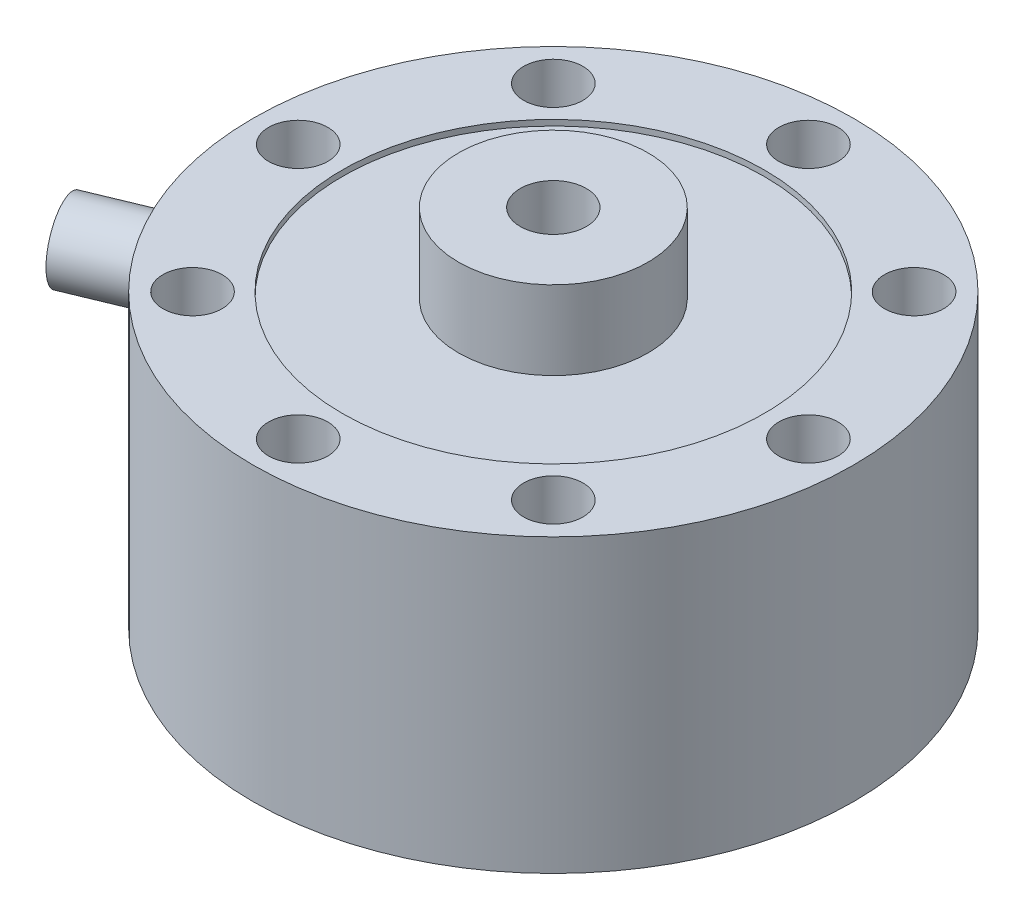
ISO-10303-21;
HEADER;
FILE_DESCRIPTION(('STEP AP214'),'2;1');
FILE_NAME('part.step','',(''),(''),'','','');
FILE_SCHEMA(('AUTOMOTIVE_DESIGN { 1 0 10303 214 1 1 1 1 }'));
ENDSEC;
DATA;
#1=APPLICATION_CONTEXT('core data for automotive mechanical design processes');
#2=APPLICATION_PROTOCOL_DEFINITION('international standard','automotive_design',2000,#1);
#3=PRODUCT_CONTEXT('',#1,'mechanical');
#4=PRODUCT('Part','Part','',(#3));
#5=PRODUCT_RELATED_PRODUCT_CATEGORY('part','',(#4));
#6=PRODUCT_DEFINITION_FORMATION('','',#4);
#7=PRODUCT_DEFINITION_CONTEXT('part definition',#1,'design');
#8=PRODUCT_DEFINITION('design','',#6,#7);
#9=PRODUCT_DEFINITION_SHAPE('','',#8);
#10=(LENGTH_UNIT() NAMED_UNIT(*) SI_UNIT(.MILLI.,.METRE.));
#11=(NAMED_UNIT(*) PLANE_ANGLE_UNIT() SI_UNIT($,.RADIAN.));
#12=(NAMED_UNIT(*) SI_UNIT($,.STERADIAN.) SOLID_ANGLE_UNIT());
#13=UNCERTAINTY_MEASURE_WITH_UNIT(LENGTH_MEASURE(1.E-05),#10,'distance_accuracy_value','');
#14=(GEOMETRIC_REPRESENTATION_CONTEXT(3) GLOBAL_UNCERTAINTY_ASSIGNED_CONTEXT((#13)) GLOBAL_UNIT_ASSIGNED_CONTEXT((#10,
#11,#12)) REPRESENTATION_CONTEXT('',''));
#15=CARTESIAN_POINT('',(0.,0.,0.));
#16=DIRECTION('',(0.,0.,1.));
#17=DIRECTION('',(1.,0.,0.));
#18=AXIS2_PLACEMENT_3D('',#15,#16,#17);
#19=CARTESIAN_POINT('',(0.,50.8,0.));
#20=DIRECTION('',(0.,-1.,0.));
#21=DIRECTION('',(0.,0.,-1.));
#22=AXIS2_PLACEMENT_3D('',#19,#20,#21);
#23=CYLINDRICAL_SURFACE('',#22,52.324);
#24=CARTESIAN_POINT('',(0.,50.8,0.));
#25=DIRECTION('',(0.,1.,0.));
#26=DIRECTION('',(0.,0.,1.));
#27=AXIS2_PLACEMENT_3D('',#24,#25,#26);
#28=CIRCLE('',#27,52.324);
#29=CARTESIAN_POINT('',(0.,50.8,52.324));
#30=VERTEX_POINT('',#29);
#31=EDGE_CURVE('E84',#30,#30,#28,.T.);
#32=ORIENTED_EDGE('',*,*,#31,.F.);
#33=EDGE_LOOP('',(#32));
#34=FACE_BOUND('',#33,.T.);
#35=CARTESIAN_POINT('',(0.,0.,0.));
#36=DIRECTION('',(0.,1.,0.));
#37=DIRECTION('',(0.,0.,1.));
#38=AXIS2_PLACEMENT_3D('',#35,#36,#37);
#39=CIRCLE('',#38,52.324);
#40=CARTESIAN_POINT('',(0.,0.,52.324));
#41=VERTEX_POINT('',#40);
#42=EDGE_CURVE('E83',#41,#41,#39,.T.);
#43=ORIENTED_EDGE('',*,*,#42,.T.);
#44=EDGE_LOOP('',(#43));
#45=FACE_BOUND('',#44,.T.);
#46=CARTESIAN_POINT('',(-50.4138068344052,41.0196834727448,14.0088920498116));
#47=CARTESIAN_POINT('',(-50.4138069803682,40.8419859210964,14.0088899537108));
#48=CARTESIAN_POINT('',(-50.4117956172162,40.6643177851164,14.0161354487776));
#49=CARTESIAN_POINT('',(-50.4037465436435,40.3101950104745,14.0450541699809));
#50=CARTESIAN_POINT('',(-50.397707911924,40.133740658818,14.066730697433));
#51=CARTESIAN_POINT('',(-50.3815883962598,39.7832327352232,14.1243554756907));
#52=CARTESIAN_POINT('',(-50.3715044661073,39.6091810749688,14.1603144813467));
#53=CARTESIAN_POINT('',(-50.3472767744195,39.2647835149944,14.2462166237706));
#54=CARTESIAN_POINT('',(-50.3331315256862,39.0944389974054,14.2961648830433));
#55=CARTESIAN_POINT('',(-50.3007840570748,38.7589026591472,14.4095651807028));
#56=CARTESIAN_POINT('',(-50.2825860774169,38.5937056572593,14.4730031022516));
#57=CARTESIAN_POINT('',(-50.2421024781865,38.2693763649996,14.6129195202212));
#58=CARTESIAN_POINT('',(-50.2198153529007,38.1102463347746,14.6894028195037));
#59=CARTESIAN_POINT('',(-50.171160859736,37.7993100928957,14.8547302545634));
#60=CARTESIAN_POINT('',(-50.144795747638,37.647499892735,14.9435675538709));
#61=CARTESIAN_POINT('',(-50.0879640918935,37.3521057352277,15.1329641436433));
#62=CARTESIAN_POINT('',(-50.0574960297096,37.2085248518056,15.2335277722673));
#63=CARTESIAN_POINT('',(-49.9923363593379,36.9300369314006,15.4460247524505));
#64=CARTESIAN_POINT('',(-49.9576269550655,36.7951703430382,15.5580056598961));
#65=CARTESIAN_POINT('',(-49.8841086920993,36.5356883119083,15.7921415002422));
#66=CARTESIAN_POINT('',(-49.8452983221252,36.4110766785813,15.9143001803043));
#67=CARTESIAN_POINT('',(-49.7636590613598,36.1730688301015,16.1677744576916));
#68=CARTESIAN_POINT('',(-49.7208314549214,36.0596690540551,16.2990871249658));
#69=CARTESIAN_POINT('',(-49.6312200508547,35.8447969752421,16.5699524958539));
#70=CARTESIAN_POINT('',(-49.5844347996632,35.7433290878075,16.7095082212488));
#71=CARTESIAN_POINT('',(-49.4869141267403,35.5528267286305,16.9961548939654));
#72=CARTESIAN_POINT('',(-49.4361681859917,35.4638272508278,17.14326552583));
#73=CARTESIAN_POINT('',(-49.3309936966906,35.2992048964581,17.4436053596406));
#74=CARTESIAN_POINT('',(-49.2765637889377,35.2235869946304,17.596836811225));
#75=CARTESIAN_POINT('',(-49.1642746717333,35.0863468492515,17.9081660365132));
#76=CARTESIAN_POINT('',(-49.1064168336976,35.0247190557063,18.0662618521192));
#77=CARTESIAN_POINT('',(-48.9875303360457,34.9158572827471,18.3861925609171));
#78=CARTESIAN_POINT('',(-48.9265005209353,34.8686285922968,18.5480288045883));
#79=CARTESIAN_POINT('',(-48.7397829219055,34.7495769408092,19.0356133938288));
#80=CARTESIAN_POINT('',(-48.609784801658,34.6995542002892,19.3653374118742));
#81=CARTESIAN_POINT('',(-48.3417930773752,34.659667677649,20.024958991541));
#82=CARTESIAN_POINT('',(-48.2037997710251,34.6698016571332,20.3548565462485));
#83=CARTESIAN_POINT('',(-47.9245365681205,34.74962744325,21.0039014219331));
#84=CARTESIAN_POINT('',(-47.7832877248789,34.819005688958,21.3230961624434));
#85=CARTESIAN_POINT('',(-47.5014653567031,35.0148818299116,21.9437471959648));
#86=CARTESIAN_POINT('',(-47.3608918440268,35.1413807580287,22.2452031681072));
#87=CARTESIAN_POINT('',(-47.0850982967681,35.4482369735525,22.8231765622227));
#88=CARTESIAN_POINT('',(-46.9498927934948,35.6287304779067,23.0996285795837));
#89=CARTESIAN_POINT('',(-46.6904260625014,36.0383547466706,23.619688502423));
#90=CARTESIAN_POINT('',(-46.566165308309,36.2674876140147,23.863294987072));
#91=CARTESIAN_POINT('',(-46.3329246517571,36.7696438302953,24.3130788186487));
#92=CARTESIAN_POINT('',(-46.2240483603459,37.0429404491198,24.5190049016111));
#93=CARTESIAN_POINT('',(-46.0272991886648,37.6247262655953,24.886387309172));
#94=CARTESIAN_POINT('',(-45.9394263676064,37.9332155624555,25.0478435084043));
#95=CARTESIAN_POINT('',(-45.7886938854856,38.576866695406,25.3223446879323));
#96=CARTESIAN_POINT('',(-45.7258438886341,38.9120387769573,25.4353709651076));
#97=CARTESIAN_POINT('',(-45.6282250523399,39.5994189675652,25.610079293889));
#98=CARTESIAN_POINT('',(-45.5934549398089,39.9516263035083,25.6717636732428));
#99=CARTESIAN_POINT('',(-45.5538354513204,40.660680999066,25.7420025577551));
#100=CARTESIAN_POINT('',(-45.548797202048,41.0174846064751,25.7508924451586));
#101=CARTESIAN_POINT('',(-45.5683843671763,41.7277057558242,25.7162147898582));
#102=CARTESIAN_POINT('',(-45.5930091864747,42.0811233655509,25.6726482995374));
#103=CARTESIAN_POINT('',(-45.6705882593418,42.7734001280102,25.5343793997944));
#104=CARTESIAN_POINT('',(-45.7234526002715,43.112301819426,25.4398392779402));
#105=CARTESIAN_POINT('',(-45.8549359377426,43.7672559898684,25.2020668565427));
#106=CARTESIAN_POINT('',(-45.9335557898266,44.0833077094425,25.0588329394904));
#107=CARTESIAN_POINT('',(-46.1133933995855,44.6853213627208,24.7263360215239));
#108=CARTESIAN_POINT('',(-46.2147218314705,44.9711254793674,24.5368471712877));
#109=CARTESIAN_POINT('',(-46.4352752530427,45.5029221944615,24.1168468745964));
#110=CARTESIAN_POINT('',(-46.5545008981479,45.7489133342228,23.8863339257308));
#111=CARTESIAN_POINT('',(-46.8065231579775,46.1954402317,23.3886392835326));
#112=CARTESIAN_POINT('',(-46.9393891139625,46.3957251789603,23.1212675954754));
#113=CARTESIAN_POINT('',(-47.2128396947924,46.7434186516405,22.5576303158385));
#114=CARTESIAN_POINT('',(-47.353424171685,46.8908281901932,22.2613652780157));
#115=CARTESIAN_POINT('',(-47.6366548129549,47.128177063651,21.6486426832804));
#116=CARTESIAN_POINT('',(-47.7792947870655,47.218262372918,21.3322386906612));
#117=CARTESIAN_POINT('',(-48.0621635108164,47.3388564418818,20.6870280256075));
#118=CARTESIAN_POINT('',(-48.2023923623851,47.369367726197,20.3582218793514));
#119=CARTESIAN_POINT('',(-48.4070648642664,47.369837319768,19.8642622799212));
#120=CARTESIAN_POINT('',(-48.474170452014,47.3625244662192,19.6999283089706));
#121=CARTESIAN_POINT('',(-48.606248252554,47.3330681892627,19.3717520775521));
#122=CARTESIAN_POINT('',(-48.6712212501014,47.3109302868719,19.2079096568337));
#123=CARTESIAN_POINT('',(-48.7986457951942,47.2519702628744,18.8818385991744));
#124=CARTESIAN_POINT('',(-48.8610964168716,47.2151428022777,18.7196105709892));
#125=CARTESIAN_POINT('',(-48.9830789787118,47.1270946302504,18.3980569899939));
#126=CARTESIAN_POINT('',(-49.0426119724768,47.0758791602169,18.2387304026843));
#127=CARTESIAN_POINT('',(-49.1584811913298,46.9594195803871,17.9240848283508));
#128=CARTESIAN_POINT('',(-49.2148172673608,46.8941748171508,17.7687660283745));
#129=CARTESIAN_POINT('',(-49.324019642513,46.7501555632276,17.46334325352));
#130=CARTESIAN_POINT('',(-49.376887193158,46.6713859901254,17.3132374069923));
#131=CARTESIAN_POINT('',(-49.4789927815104,46.5008311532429,17.0192384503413));
#132=CARTESIAN_POINT('',(-49.528229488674,46.4090411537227,16.8753476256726));
#133=CARTESIAN_POINT('',(-49.6228800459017,46.2131502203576,16.5949583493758));
#134=CARTESIAN_POINT('',(-49.6682952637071,46.1090537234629,16.4584572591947));
#135=CARTESIAN_POINT('',(-49.7554935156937,45.8885293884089,16.1929459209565));
#136=CARTESIAN_POINT('',(-49.7972508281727,45.7720252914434,16.0639905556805));
#137=CARTESIAN_POINT('',(-49.8767024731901,45.528115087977,15.8155787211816));
#138=CARTESIAN_POINT('',(-49.9143982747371,45.4007129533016,15.6961188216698));
#139=CARTESIAN_POINT('',(-49.9857161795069,45.1357781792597,15.4674983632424));
#140=CARTESIAN_POINT('',(-50.0193358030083,44.9982394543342,15.3583440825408));
#141=CARTESIAN_POINT('',(-50.0824371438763,44.7141110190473,15.1513094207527));
#142=CARTESIAN_POINT('',(-50.1119203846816,44.5675246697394,15.0534248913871));
#143=CARTESIAN_POINT('',(-50.1668664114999,44.2656695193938,14.8692892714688));
#144=CARTESIAN_POINT('',(-50.1923125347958,44.1103681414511,14.7830865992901));
#145=CARTESIAN_POINT('',(-50.2390365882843,43.7927804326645,14.6235115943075));
#146=CARTESIAN_POINT('',(-50.2603160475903,43.6304966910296,14.550134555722));
#147=CARTESIAN_POINT('',(-50.2987160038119,43.3001669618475,14.4168289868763));
#148=CARTESIAN_POINT('',(-50.3158397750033,43.1321256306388,14.356889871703));
#149=CARTESIAN_POINT('',(-50.3459611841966,42.7914174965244,14.2509015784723));
#150=CARTESIAN_POINT('',(-50.358959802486,42.6187518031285,14.2048491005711));
#151=CARTESIAN_POINT('',(-50.3845509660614,42.2110482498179,14.1138577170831));
#152=CARTESIAN_POINT('',(-50.3955254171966,41.9746299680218,14.0745417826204));
#153=CARTESIAN_POINT('',(-50.4101532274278,41.498684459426,14.0220604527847));
#154=CARTESIAN_POINT('',(-50.4138066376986,41.2591572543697,14.0088948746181));
#155=CARTESIAN_POINT('',(-50.4138068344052,41.0196834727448,14.0088920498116));
#156=B_SPLINE_CURVE_WITH_KNOTS('',3,(#46,#47,#48,#49,#50,#51,#52,#53,#54,#55,#56,#57,#58,#59,
#60,#61,#62,#63,#64,#65,#66,#67,#68,#69,#70,#71,#72,#73,#74,#75,#76,#77,#78,#79,#80,#81,#82,#83,
#84,#85,#86,#87,#88,#89,#90,#91,#92,#93,#94,#95,#96,#97,#98,#99,#100,#101,#102,#103,#104,#105,
#106,#107,#108,#109,#110,#111,#112,#113,#114,#115,#116,#117,#118,#119,#120,#121,#122,#123,#124,
#125,#126,#127,#128,#129,#130,#131,#132,#133,#134,#135,#136,#137,#138,#139,#140,#141,#142,#143,
#144,#145,#146,#147,#148,#149,#150,#151,#152,#153,#154,#155),.UNSPECIFIED.,.T.,.F.,(4,2,2,2,2,2,
2,2,2,2,2,2,2,2,2,2,2,2,2,2,2,2,2,2,2,2,2,2,2,2,2,2,2,2,2,2,2,2,2,2,2,2,2,2,2,2,2,2,2,2,2,2,2,2,
4),(0.,0.532883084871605,1.06588811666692,1.59929526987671,2.13289799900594,2.66594504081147,
3.19918875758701,3.73213855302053,4.26528614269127,4.80075295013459,5.33641777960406,
5.87191193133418,6.40760362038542,6.94476989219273,7.48213544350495,8.01928744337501,
8.55663650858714,9.62486578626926,10.6930553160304,11.7556260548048,12.818216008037,
13.8835095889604,14.9488492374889,16.0210527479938,17.0932592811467,18.1658795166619,
19.2384511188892,20.3042017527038,21.3699310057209,22.4322871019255,23.4946784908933,
24.5623647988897,25.6300902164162,26.7035409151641,27.7769710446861,28.8476566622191,
29.9182969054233,30.4507520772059,30.9830090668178,31.5154596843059,32.0477165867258,
32.5799982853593,33.112086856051,33.6443694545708,34.1764607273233,34.7120349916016,
35.2474148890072,35.7831188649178,36.3186250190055,36.8562869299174,37.3937511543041,
37.9307905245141,38.467702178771,39.1858461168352,39.9039850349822),.UNSPECIFIED.);
#157=CARTESIAN_POINT('',(-50.4138068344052,41.0196834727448,14.0088920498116));
#158=VERTEX_POINT('',#157);
#159=EDGE_CURVE('E11',#158,#158,#156,.T.);
#160=ORIENTED_EDGE('',*,*,#159,.F.);
#161=EDGE_LOOP('',(#160));
#162=FACE_BOUND('',#161,.T.);
#163=ADVANCED_FACE('F37',(#34,#45,#162),#23,.T.);
#164=CARTESIAN_POINT('',(-31.4308964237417,-1.27,-31.4308964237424));
#165=DIRECTION('',(0.,1.,0.));
#166=DIRECTION('',(0.,0.,1.));
#167=AXIS2_PLACEMENT_3D('',#164,#165,#166);
#168=CYLINDRICAL_SURFACE('',#167,3.5941);
#169=CARTESIAN_POINT('',(-31.4308964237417,0.,-31.4308964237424));
#170=DIRECTION('',(0.,1.,0.));
#171=DIRECTION('',(0.,0.,1.));
#172=AXIS2_PLACEMENT_3D('',#169,#170,#171);
#173=CIRCLE('',#172,3.5941);
#174=CARTESIAN_POINT('',(-31.4308964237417,0.,-27.8367964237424));
#175=VERTEX_POINT('',#174);
#176=EDGE_CURVE('E98',#175,#175,#173,.T.);
#177=CARTESIAN_POINT('',(-31.4308964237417,43.18,-31.4308964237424));
#178=DIRECTION('',(0.,1.,0.));
#179=DIRECTION('',(0.,0.,1.));
#180=AXIS2_PLACEMENT_3D('',#177,#178,#179);
#181=CIRCLE('',#180,3.5941);
#182=CARTESIAN_POINT('',(-31.4308964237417,43.18,-27.8367964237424));
#183=VERTEX_POINT('',#182);
#184=EDGE_CURVE('E115',#183,#183,#181,.F.);
#185=CARTESIAN_POINT('',(-31.4308964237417,0.,-27.8367964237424));
#186=CARTESIAN_POINT('',(-31.4308964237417,0.449791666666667,-27.8367964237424));
#187=CARTESIAN_POINT('',(-31.4308964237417,0.899583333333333,-27.8367964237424));
#188=CARTESIAN_POINT('',(-31.4308964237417,1.79916666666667,-27.8367964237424));
#189=CARTESIAN_POINT('',(-31.4308964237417,2.24895833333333,-27.8367964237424));
#190=CARTESIAN_POINT('',(-31.4308964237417,3.14854166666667,-27.8367964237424));
#191=CARTESIAN_POINT('',(-31.4308964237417,3.59833333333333,-27.8367964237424));
#192=CARTESIAN_POINT('',(-31.4308964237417,4.49791666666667,-27.8367964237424));
#193=CARTESIAN_POINT('',(-31.4308964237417,4.94770833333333,-27.8367964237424));
#194=CARTESIAN_POINT('',(-31.4308964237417,5.84729166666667,-27.8367964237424));
#195=CARTESIAN_POINT('',(-31.4308964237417,6.29708333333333,-27.8367964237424));
#196=CARTESIAN_POINT('',(-31.4308964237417,7.19666666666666,-27.8367964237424));
#197=CARTESIAN_POINT('',(-31.4308964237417,7.64645833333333,-27.8367964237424));
#198=CARTESIAN_POINT('',(-31.4308964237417,8.54604166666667,-27.8367964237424));
#199=CARTESIAN_POINT('',(-31.4308964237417,8.99583333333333,-27.8367964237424));
#200=CARTESIAN_POINT('',(-31.4308964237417,9.89541666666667,-27.8367964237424));
#201=CARTESIAN_POINT('',(-31.4308964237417,10.3452083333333,-27.8367964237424));
#202=CARTESIAN_POINT('',(-31.4308964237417,11.2447916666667,-27.8367964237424));
#203=CARTESIAN_POINT('',(-31.4308964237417,11.6945833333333,-27.8367964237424));
#204=CARTESIAN_POINT('',(-31.4308964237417,12.5941666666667,-27.8367964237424));
#205=CARTESIAN_POINT('',(-31.4308964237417,13.0439583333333,-27.8367964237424));
#206=CARTESIAN_POINT('',(-31.4308964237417,13.9435416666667,-27.8367964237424));
#207=CARTESIAN_POINT('',(-31.4308964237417,14.3933333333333,-27.8367964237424));
#208=CARTESIAN_POINT('',(-31.4308964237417,15.2929166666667,-27.8367964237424));
#209=CARTESIAN_POINT('',(-31.4308964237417,15.7427083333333,-27.8367964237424));
#210=CARTESIAN_POINT('',(-31.4308964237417,16.6422916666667,-27.8367964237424));
#211=CARTESIAN_POINT('',(-31.4308964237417,17.0920833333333,-27.8367964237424));
#212=CARTESIAN_POINT('',(-31.4308964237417,17.9916666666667,-27.8367964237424));
#213=CARTESIAN_POINT('',(-31.4308964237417,18.4414583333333,-27.8367964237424));
#214=CARTESIAN_POINT('',(-31.4308964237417,19.3410416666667,-27.8367964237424));
#215=CARTESIAN_POINT('',(-31.4308964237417,19.7908333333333,-27.8367964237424));
#216=CARTESIAN_POINT('',(-31.4308964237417,20.6904166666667,-27.8367964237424));
#217=CARTESIAN_POINT('',(-31.4308964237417,21.1402083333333,-27.8367964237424));
#218=CARTESIAN_POINT('',(-31.4308964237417,22.0397916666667,-27.8367964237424));
#219=CARTESIAN_POINT('',(-31.4308964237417,22.4895833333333,-27.8367964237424));
#220=CARTESIAN_POINT('',(-31.4308964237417,23.3891666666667,-27.8367964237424));
#221=CARTESIAN_POINT('',(-31.4308964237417,23.8389583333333,-27.8367964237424));
#222=CARTESIAN_POINT('',(-31.4308964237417,24.7385416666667,-27.8367964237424));
#223=CARTESIAN_POINT('',(-31.4308964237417,25.1883333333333,-27.8367964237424));
#224=CARTESIAN_POINT('',(-31.4308964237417,26.0879166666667,-27.8367964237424));
#225=CARTESIAN_POINT('',(-31.4308964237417,26.5377083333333,-27.8367964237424));
#226=CARTESIAN_POINT('',(-31.4308964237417,27.4372916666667,-27.8367964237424));
#227=CARTESIAN_POINT('',(-31.4308964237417,27.8870833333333,-27.8367964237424));
#228=CARTESIAN_POINT('',(-31.4308964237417,28.7866666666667,-27.8367964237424));
#229=CARTESIAN_POINT('',(-31.4308964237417,29.2364583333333,-27.8367964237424));
#230=CARTESIAN_POINT('',(-31.4308964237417,30.1360416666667,-27.8367964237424));
#231=CARTESIAN_POINT('',(-31.4308964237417,30.5858333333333,-27.8367964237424));
#232=CARTESIAN_POINT('',(-31.4308964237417,31.4854166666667,-27.8367964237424));
#233=CARTESIAN_POINT('',(-31.4308964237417,31.9352083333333,-27.8367964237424));
#234=CARTESIAN_POINT('',(-31.4308964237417,32.8347916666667,-27.8367964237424));
#235=CARTESIAN_POINT('',(-31.4308964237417,33.2845833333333,-27.8367964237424));
#236=CARTESIAN_POINT('',(-31.4308964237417,34.1841666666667,-27.8367964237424));
#237=CARTESIAN_POINT('',(-31.4308964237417,34.6339583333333,-27.8367964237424));
#238=CARTESIAN_POINT('',(-31.4308964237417,35.5335416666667,-27.8367964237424));
#239=CARTESIAN_POINT('',(-31.4308964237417,35.9833333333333,-27.8367964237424));
#240=CARTESIAN_POINT('',(-31.4308964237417,36.8829166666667,-27.8367964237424));
#241=CARTESIAN_POINT('',(-31.4308964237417,37.3327083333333,-27.8367964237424));
#242=CARTESIAN_POINT('',(-31.4308964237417,38.2322916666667,-27.8367964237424));
#243=CARTESIAN_POINT('',(-31.4308964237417,38.6820833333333,-27.8367964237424));
#244=CARTESIAN_POINT('',(-31.4308964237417,39.5816666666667,-27.8367964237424));
#245=CARTESIAN_POINT('',(-31.4308964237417,40.0314583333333,-27.8367964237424));
#246=CARTESIAN_POINT('',(-31.4308964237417,40.9310416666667,-27.8367964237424));
#247=CARTESIAN_POINT('',(-31.4308964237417,41.3808333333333,-27.8367964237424));
#248=CARTESIAN_POINT('',(-31.4308964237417,42.2804166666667,-27.8367964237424));
#249=CARTESIAN_POINT('',(-31.4308964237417,42.7302083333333,-27.8367964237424));
#250=CARTESIAN_POINT('',(-31.4308964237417,43.18,-27.8367964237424));
#251=B_SPLINE_CURVE_WITH_KNOTS('',3,(#185,#186,#187,#188,#189,#190,#191,#192,#193,#194,#195,
#196,#197,#198,#199,#200,#201,#202,#203,#204,#205,#206,#207,#208,#209,#210,#211,#212,#213,#214,
#215,#216,#217,#218,#219,#220,#221,#222,#223,#224,#225,#226,#227,#228,#229,#230,#231,#232,#233,
#234,#235,#236,#237,#238,#239,#240,#241,#242,#243,#244,#245,#246,#247,#248,#249,#250),
.UNSPECIFIED.,.F.,.F.,(4,2,2,2,2,2,2,2,2,2,2,2,2,2,2,2,2,2,2,2,2,2,2,2,2,2,2,2,2,2,2,2,4),(0.,
1.349375,2.69875,4.048125,5.3975,6.746875,8.09625,9.445625,10.795,12.144375,13.49375,14.843125,
16.1925,17.541875,18.89125,20.240625,21.59,22.939375,24.28875,25.638125,26.9875,28.336875,
29.68625,31.035625,32.385,33.734375,35.08375,36.433125,37.7825,39.131875,40.48125,41.830625,
43.18),.UNSPECIFIED.);
#252=EDGE_CURVE('BSEAM180',#175,#183,#251,.T.);
#253=ORIENTED_EDGE('',*,*,#176,.F.);
#254=ORIENTED_EDGE('',*,*,#184,.F.);
#255=ORIENTED_EDGE('',*,*,#252,.T.);
#256=ORIENTED_EDGE('',*,*,#252,.F.);
#257=EDGE_LOOP('',(#253,#255,#254,#256));
#258=FACE_BOUND('',#257,.T.);
#259=ADVANCED_FACE('F180',(#258),#168,.F.);
#260=CARTESIAN_POINT('',(-44.45,-1.27,-4.65589036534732E-13));
#261=DIRECTION('',(0.,1.,0.));
#262=DIRECTION('',(0.,0.,1.));
#263=AXIS2_PLACEMENT_3D('',#260,#261,#262);
#264=CYLINDRICAL_SURFACE('',#263,3.5941);
#265=CARTESIAN_POINT('',(-44.45,0.,-4.65589036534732E-13));
#266=DIRECTION('',(0.,1.,0.));
#267=DIRECTION('',(0.,0.,1.));
#268=AXIS2_PLACEMENT_3D('',#265,#266,#267);
#269=CIRCLE('',#268,3.5941);
#270=CARTESIAN_POINT('',(-44.45,0.,3.59409999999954));
#271=VERTEX_POINT('',#270);
#272=EDGE_CURVE('E130',#271,#271,#269,.T.);
#273=CARTESIAN_POINT('',(-44.45,43.18,-4.65589036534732E-13));
#274=DIRECTION('',(0.,1.,0.));
#275=DIRECTION('',(0.,0.,1.));
#276=AXIS2_PLACEMENT_3D('',#273,#274,#275);
#277=CIRCLE('',#276,3.5941);
#278=CARTESIAN_POINT('',(-44.45,43.18,3.59409999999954));
#279=VERTEX_POINT('',#278);
#280=EDGE_CURVE('E113',#279,#279,#277,.F.);
#281=CARTESIAN_POINT('',(-44.45,0.,3.59409999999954));
#282=CARTESIAN_POINT('',(-44.45,0.449791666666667,3.59409999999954));
#283=CARTESIAN_POINT('',(-44.45,0.899583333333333,3.59409999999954));
#284=CARTESIAN_POINT('',(-44.45,1.79916666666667,3.59409999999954));
#285=CARTESIAN_POINT('',(-44.45,2.24895833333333,3.59409999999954));
#286=CARTESIAN_POINT('',(-44.45,3.14854166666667,3.59409999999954));
#287=CARTESIAN_POINT('',(-44.45,3.59833333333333,3.59409999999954));
#288=CARTESIAN_POINT('',(-44.45,4.49791666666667,3.59409999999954));
#289=CARTESIAN_POINT('',(-44.45,4.94770833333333,3.59409999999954));
#290=CARTESIAN_POINT('',(-44.45,5.84729166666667,3.59409999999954));
#291=CARTESIAN_POINT('',(-44.45,6.29708333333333,3.59409999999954));
#292=CARTESIAN_POINT('',(-44.45,7.19666666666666,3.59409999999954));
#293=CARTESIAN_POINT('',(-44.45,7.64645833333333,3.59409999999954));
#294=CARTESIAN_POINT('',(-44.45,8.54604166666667,3.59409999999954));
#295=CARTESIAN_POINT('',(-44.45,8.99583333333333,3.59409999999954));
#296=CARTESIAN_POINT('',(-44.45,9.89541666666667,3.59409999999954));
#297=CARTESIAN_POINT('',(-44.45,10.3452083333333,3.59409999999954));
#298=CARTESIAN_POINT('',(-44.45,11.2447916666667,3.59409999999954));
#299=CARTESIAN_POINT('',(-44.45,11.6945833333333,3.59409999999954));
#300=CARTESIAN_POINT('',(-44.45,12.5941666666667,3.59409999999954));
#301=CARTESIAN_POINT('',(-44.45,13.0439583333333,3.59409999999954));
#302=CARTESIAN_POINT('',(-44.45,13.9435416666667,3.59409999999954));
#303=CARTESIAN_POINT('',(-44.45,14.3933333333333,3.59409999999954));
#304=CARTESIAN_POINT('',(-44.45,15.2929166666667,3.59409999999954));
#305=CARTESIAN_POINT('',(-44.45,15.7427083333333,3.59409999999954));
#306=CARTESIAN_POINT('',(-44.45,16.6422916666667,3.59409999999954));
#307=CARTESIAN_POINT('',(-44.45,17.0920833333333,3.59409999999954));
#308=CARTESIAN_POINT('',(-44.45,17.9916666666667,3.59409999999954));
#309=CARTESIAN_POINT('',(-44.45,18.4414583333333,3.59409999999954));
#310=CARTESIAN_POINT('',(-44.45,19.3410416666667,3.59409999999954));
#311=CARTESIAN_POINT('',(-44.45,19.7908333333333,3.59409999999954));
#312=CARTESIAN_POINT('',(-44.45,20.6904166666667,3.59409999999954));
#313=CARTESIAN_POINT('',(-44.45,21.1402083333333,3.59409999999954));
#314=CARTESIAN_POINT('',(-44.45,22.0397916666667,3.59409999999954));
#315=CARTESIAN_POINT('',(-44.45,22.4895833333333,3.59409999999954));
#316=CARTESIAN_POINT('',(-44.45,23.3891666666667,3.59409999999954));
#317=CARTESIAN_POINT('',(-44.45,23.8389583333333,3.59409999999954));
#318=CARTESIAN_POINT('',(-44.45,24.7385416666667,3.59409999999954));
#319=CARTESIAN_POINT('',(-44.45,25.1883333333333,3.59409999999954));
#320=CARTESIAN_POINT('',(-44.45,26.0879166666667,3.59409999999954));
#321=CARTESIAN_POINT('',(-44.45,26.5377083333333,3.59409999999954));
#322=CARTESIAN_POINT('',(-44.45,27.4372916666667,3.59409999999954));
#323=CARTESIAN_POINT('',(-44.45,27.8870833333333,3.59409999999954));
#324=CARTESIAN_POINT('',(-44.45,28.7866666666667,3.59409999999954));
#325=CARTESIAN_POINT('',(-44.45,29.2364583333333,3.59409999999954));
#326=CARTESIAN_POINT('',(-44.45,30.1360416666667,3.59409999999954));
#327=CARTESIAN_POINT('',(-44.45,30.5858333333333,3.59409999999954));
#328=CARTESIAN_POINT('',(-44.45,31.4854166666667,3.59409999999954));
#329=CARTESIAN_POINT('',(-44.45,31.9352083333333,3.59409999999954));
#330=CARTESIAN_POINT('',(-44.45,32.8347916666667,3.59409999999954));
#331=CARTESIAN_POINT('',(-44.45,33.2845833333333,3.59409999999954));
#332=CARTESIAN_POINT('',(-44.45,34.1841666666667,3.59409999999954));
#333=CARTESIAN_POINT('',(-44.45,34.6339583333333,3.59409999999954));
#334=CARTESIAN_POINT('',(-44.45,35.5335416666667,3.59409999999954));
#335=CARTESIAN_POINT('',(-44.45,35.9833333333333,3.59409999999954));
#336=CARTESIAN_POINT('',(-44.45,36.8829166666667,3.59409999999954));
#337=CARTESIAN_POINT('',(-44.45,37.3327083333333,3.59409999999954));
#338=CARTESIAN_POINT('',(-44.45,38.2322916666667,3.59409999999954));
#339=CARTESIAN_POINT('',(-44.45,38.6820833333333,3.59409999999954));
#340=CARTESIAN_POINT('',(-44.45,39.5816666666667,3.59409999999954));
#341=CARTESIAN_POINT('',(-44.45,40.0314583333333,3.59409999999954));
#342=CARTESIAN_POINT('',(-44.45,40.9310416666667,3.59409999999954));
#343=CARTESIAN_POINT('',(-44.45,41.3808333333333,3.59409999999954));
#344=CARTESIAN_POINT('',(-44.45,42.2804166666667,3.59409999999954));
#345=CARTESIAN_POINT('',(-44.45,42.7302083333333,3.59409999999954));
#346=CARTESIAN_POINT('',(-44.45,43.18,3.59409999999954));
#347=B_SPLINE_CURVE_WITH_KNOTS('',3,(#281,#282,#283,#284,#285,#286,#287,#288,#289,#290,#291,
#292,#293,#294,#295,#296,#297,#298,#299,#300,#301,#302,#303,#304,#305,#306,#307,#308,#309,#310,
#311,#312,#313,#314,#315,#316,#317,#318,#319,#320,#321,#322,#323,#324,#325,#326,#327,#328,#329,
#330,#331,#332,#333,#334,#335,#336,#337,#338,#339,#340,#341,#342,#343,#344,#345,#346),
.UNSPECIFIED.,.F.,.F.,(4,2,2,2,2,2,2,2,2,2,2,2,2,2,2,2,2,2,2,2,2,2,2,2,2,2,2,2,2,2,2,2,4),(0.,
1.349375,2.69875,4.048125,5.3975,6.746875,8.09625,9.445625,10.795,12.144375,13.49375,14.843125,
16.1925,17.541875,18.89125,20.240625,21.59,22.939375,24.28875,25.638125,26.9875,28.336875,
29.68625,31.035625,32.385,33.734375,35.08375,36.433125,37.7825,39.131875,40.48125,41.830625,
43.18),.UNSPECIFIED.);
#348=EDGE_CURVE('BSEAM185',#271,#279,#347,.T.);
#349=ORIENTED_EDGE('',*,*,#272,.F.);
#350=ORIENTED_EDGE('',*,*,#280,.F.);
#351=ORIENTED_EDGE('',*,*,#348,.T.);
#352=ORIENTED_EDGE('',*,*,#348,.F.);
#353=EDGE_LOOP('',(#349,#351,#350,#352));
#354=FACE_BOUND('',#353,.T.);
#355=ADVANCED_FACE('F185',(#354),#264,.F.);
#356=CARTESIAN_POINT('',(-31.4308964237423,-1.27,31.4308964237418));
#357=DIRECTION('',(0.,1.,0.));
#358=DIRECTION('',(0.,0.,1.));
#359=AXIS2_PLACEMENT_3D('',#356,#357,#358);
#360=CYLINDRICAL_SURFACE('',#359,3.5941);
#361=CARTESIAN_POINT('',(-31.4308964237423,0.,31.4308964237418));
#362=DIRECTION('',(0.,1.,0.));
#363=DIRECTION('',(0.,0.,1.));
#364=AXIS2_PLACEMENT_3D('',#361,#362,#363);
#365=CIRCLE('',#364,3.5941);
#366=CARTESIAN_POINT('',(-31.4308964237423,0.,35.0249964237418));
#367=VERTEX_POINT('',#366);
#368=EDGE_CURVE('E133',#367,#367,#365,.T.);
#369=CARTESIAN_POINT('',(-31.4308964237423,43.18,31.4308964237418));
#370=DIRECTION('',(0.,1.,0.));
#371=DIRECTION('',(0.,0.,1.));
#372=AXIS2_PLACEMENT_3D('',#369,#370,#371);
#373=CIRCLE('',#372,3.5941);
#374=CARTESIAN_POINT('',(-31.4308964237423,43.18,35.0249964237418));
#375=VERTEX_POINT('',#374);
#376=EDGE_CURVE('E110',#375,#375,#373,.F.);
#377=CARTESIAN_POINT('',(-31.4308964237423,0.,35.0249964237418));
#378=CARTESIAN_POINT('',(-31.4308964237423,0.449791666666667,35.0249964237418));
#379=CARTESIAN_POINT('',(-31.4308964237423,0.899583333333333,35.0249964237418));
#380=CARTESIAN_POINT('',(-31.4308964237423,1.79916666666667,35.0249964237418));
#381=CARTESIAN_POINT('',(-31.4308964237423,2.24895833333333,35.0249964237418));
#382=CARTESIAN_POINT('',(-31.4308964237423,3.14854166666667,35.0249964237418));
#383=CARTESIAN_POINT('',(-31.4308964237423,3.59833333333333,35.0249964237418));
#384=CARTESIAN_POINT('',(-31.4308964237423,4.49791666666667,35.0249964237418));
#385=CARTESIAN_POINT('',(-31.4308964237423,4.94770833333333,35.0249964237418));
#386=CARTESIAN_POINT('',(-31.4308964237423,5.84729166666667,35.0249964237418));
#387=CARTESIAN_POINT('',(-31.4308964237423,6.29708333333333,35.0249964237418));
#388=CARTESIAN_POINT('',(-31.4308964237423,7.19666666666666,35.0249964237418));
#389=CARTESIAN_POINT('',(-31.4308964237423,7.64645833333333,35.0249964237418));
#390=CARTESIAN_POINT('',(-31.4308964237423,8.54604166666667,35.0249964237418));
#391=CARTESIAN_POINT('',(-31.4308964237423,8.99583333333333,35.0249964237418));
#392=CARTESIAN_POINT('',(-31.4308964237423,9.89541666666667,35.0249964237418));
#393=CARTESIAN_POINT('',(-31.4308964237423,10.3452083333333,35.0249964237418));
#394=CARTESIAN_POINT('',(-31.4308964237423,11.2447916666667,35.0249964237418));
#395=CARTESIAN_POINT('',(-31.4308964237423,11.6945833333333,35.0249964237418));
#396=CARTESIAN_POINT('',(-31.4308964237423,12.5941666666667,35.0249964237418));
#397=CARTESIAN_POINT('',(-31.4308964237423,13.0439583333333,35.0249964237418));
#398=CARTESIAN_POINT('',(-31.4308964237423,13.9435416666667,35.0249964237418));
#399=CARTESIAN_POINT('',(-31.4308964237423,14.3933333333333,35.0249964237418));
#400=CARTESIAN_POINT('',(-31.4308964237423,15.2929166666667,35.0249964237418));
#401=CARTESIAN_POINT('',(-31.4308964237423,15.7427083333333,35.0249964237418));
#402=CARTESIAN_POINT('',(-31.4308964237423,16.6422916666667,35.0249964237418));
#403=CARTESIAN_POINT('',(-31.4308964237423,17.0920833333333,35.0249964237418));
#404=CARTESIAN_POINT('',(-31.4308964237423,17.9916666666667,35.0249964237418));
#405=CARTESIAN_POINT('',(-31.4308964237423,18.4414583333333,35.0249964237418));
#406=CARTESIAN_POINT('',(-31.4308964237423,19.3410416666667,35.0249964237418));
#407=CARTESIAN_POINT('',(-31.4308964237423,19.7908333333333,35.0249964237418));
#408=CARTESIAN_POINT('',(-31.4308964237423,20.6904166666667,35.0249964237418));
#409=CARTESIAN_POINT('',(-31.4308964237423,21.1402083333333,35.0249964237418));
#410=CARTESIAN_POINT('',(-31.4308964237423,22.0397916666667,35.0249964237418));
#411=CARTESIAN_POINT('',(-31.4308964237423,22.4895833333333,35.0249964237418));
#412=CARTESIAN_POINT('',(-31.4308964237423,23.3891666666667,35.0249964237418));
#413=CARTESIAN_POINT('',(-31.4308964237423,23.8389583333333,35.0249964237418));
#414=CARTESIAN_POINT('',(-31.4308964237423,24.7385416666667,35.0249964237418));
#415=CARTESIAN_POINT('',(-31.4308964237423,25.1883333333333,35.0249964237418));
#416=CARTESIAN_POINT('',(-31.4308964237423,26.0879166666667,35.0249964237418));
#417=CARTESIAN_POINT('',(-31.4308964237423,26.5377083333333,35.0249964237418));
#418=CARTESIAN_POINT('',(-31.4308964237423,27.4372916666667,35.0249964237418));
#419=CARTESIAN_POINT('',(-31.4308964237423,27.8870833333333,35.0249964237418));
#420=CARTESIAN_POINT('',(-31.4308964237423,28.7866666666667,35.0249964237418));
#421=CARTESIAN_POINT('',(-31.4308964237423,29.2364583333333,35.0249964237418));
#422=CARTESIAN_POINT('',(-31.4308964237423,30.1360416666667,35.0249964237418));
#423=CARTESIAN_POINT('',(-31.4308964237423,30.5858333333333,35.0249964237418));
#424=CARTESIAN_POINT('',(-31.4308964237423,31.4854166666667,35.0249964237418));
#425=CARTESIAN_POINT('',(-31.4308964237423,31.9352083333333,35.0249964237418));
#426=CARTESIAN_POINT('',(-31.4308964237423,32.8347916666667,35.0249964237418));
#427=CARTESIAN_POINT('',(-31.4308964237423,33.2845833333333,35.0249964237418));
#428=CARTESIAN_POINT('',(-31.4308964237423,34.1841666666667,35.0249964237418));
#429=CARTESIAN_POINT('',(-31.4308964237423,34.6339583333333,35.0249964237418));
#430=CARTESIAN_POINT('',(-31.4308964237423,35.5335416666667,35.0249964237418));
#431=CARTESIAN_POINT('',(-31.4308964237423,35.9833333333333,35.0249964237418));
#432=CARTESIAN_POINT('',(-31.4308964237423,36.8829166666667,35.0249964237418));
#433=CARTESIAN_POINT('',(-31.4308964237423,37.3327083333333,35.0249964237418));
#434=CARTESIAN_POINT('',(-31.4308964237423,38.2322916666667,35.0249964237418));
#435=CARTESIAN_POINT('',(-31.4308964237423,38.6820833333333,35.0249964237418));
#436=CARTESIAN_POINT('',(-31.4308964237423,39.5816666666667,35.0249964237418));
#437=CARTESIAN_POINT('',(-31.4308964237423,40.0314583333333,35.0249964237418));
#438=CARTESIAN_POINT('',(-31.4308964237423,40.9310416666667,35.0249964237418));
#439=CARTESIAN_POINT('',(-31.4308964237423,41.3808333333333,35.0249964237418));
#440=CARTESIAN_POINT('',(-31.4308964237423,42.2804166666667,35.0249964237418));
#441=CARTESIAN_POINT('',(-31.4308964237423,42.7302083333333,35.0249964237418));
#442=CARTESIAN_POINT('',(-31.4308964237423,43.18,35.0249964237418));
#443=B_SPLINE_CURVE_WITH_KNOTS('',3,(#377,#378,#379,#380,#381,#382,#383,#384,#385,#386,#387,
#388,#389,#390,#391,#392,#393,#394,#395,#396,#397,#398,#399,#400,#401,#402,#403,#404,#405,#406,
#407,#408,#409,#410,#411,#412,#413,#414,#415,#416,#417,#418,#419,#420,#421,#422,#423,#424,#425,
#426,#427,#428,#429,#430,#431,#432,#433,#434,#435,#436,#437,#438,#439,#440,#441,#442),
.UNSPECIFIED.,.F.,.F.,(4,2,2,2,2,2,2,2,2,2,2,2,2,2,2,2,2,2,2,2,2,2,2,2,2,2,2,2,2,2,2,2,4),(0.,
1.349375,2.69875,4.048125,5.3975,6.746875,8.09625,9.445625,10.795,12.144375,13.49375,14.843125,
16.1925,17.541875,18.89125,20.240625,21.59,22.939375,24.28875,25.638125,26.9875,28.336875,
29.68625,31.035625,32.385,33.734375,35.08375,36.433125,37.7825,39.131875,40.48125,41.830625,
43.18),.UNSPECIFIED.);
#444=EDGE_CURVE('BSEAM286',#367,#375,#443,.T.);
#445=ORIENTED_EDGE('',*,*,#368,.F.);
#446=ORIENTED_EDGE('',*,*,#376,.F.);
#447=ORIENTED_EDGE('',*,*,#444,.T.);
#448=ORIENTED_EDGE('',*,*,#444,.F.);
#449=EDGE_LOOP('',(#445,#447,#446,#448));
#450=FACE_BOUND('',#449,.T.);
#451=ADVANCED_FACE('F286',(#450),#360,.F.);
#452=CARTESIAN_POINT('',(0.,-1.27,44.45));
#453=DIRECTION('',(0.,1.,0.));
#454=DIRECTION('',(0.,0.,1.));
#455=AXIS2_PLACEMENT_3D('',#452,#453,#454);
#456=CYLINDRICAL_SURFACE('',#455,3.5941);
#457=CARTESIAN_POINT('',(0.,0.,44.45));
#458=DIRECTION('',(0.,1.,0.));
#459=DIRECTION('',(0.,0.,1.));
#460=AXIS2_PLACEMENT_3D('',#457,#458,#459);
#461=CIRCLE('',#460,3.5941);
#462=CARTESIAN_POINT('',(0.,0.,48.0441));
#463=VERTEX_POINT('',#462);
#464=EDGE_CURVE('E136',#463,#463,#461,.T.);
#465=CARTESIAN_POINT('',(0.,43.18,44.45));
#466=DIRECTION('',(0.,1.,0.));
#467=DIRECTION('',(0.,0.,1.));
#468=AXIS2_PLACEMENT_3D('',#465,#466,#467);
#469=CIRCLE('',#468,3.5941);
#470=CARTESIAN_POINT('',(0.,43.18,48.0441));
#471=VERTEX_POINT('',#470);
#472=EDGE_CURVE('E107',#471,#471,#469,.F.);
#473=CARTESIAN_POINT('',(0.,0.,48.0441));
#474=CARTESIAN_POINT('',(0.,0.449791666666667,48.0441));
#475=CARTESIAN_POINT('',(0.,0.899583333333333,48.0441));
#476=CARTESIAN_POINT('',(0.,1.79916666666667,48.0441));
#477=CARTESIAN_POINT('',(0.,2.24895833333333,48.0441));
#478=CARTESIAN_POINT('',(0.,3.14854166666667,48.0441));
#479=CARTESIAN_POINT('',(0.,3.59833333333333,48.0441));
#480=CARTESIAN_POINT('',(0.,4.49791666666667,48.0441));
#481=CARTESIAN_POINT('',(0.,4.94770833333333,48.0441));
#482=CARTESIAN_POINT('',(0.,5.84729166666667,48.0441));
#483=CARTESIAN_POINT('',(0.,6.29708333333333,48.0441));
#484=CARTESIAN_POINT('',(0.,7.19666666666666,48.0441));
#485=CARTESIAN_POINT('',(0.,7.64645833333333,48.0441));
#486=CARTESIAN_POINT('',(0.,8.54604166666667,48.0441));
#487=CARTESIAN_POINT('',(0.,8.99583333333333,48.0441));
#488=CARTESIAN_POINT('',(0.,9.89541666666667,48.0441));
#489=CARTESIAN_POINT('',(0.,10.3452083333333,48.0441));
#490=CARTESIAN_POINT('',(0.,11.2447916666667,48.0441));
#491=CARTESIAN_POINT('',(0.,11.6945833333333,48.0441));
#492=CARTESIAN_POINT('',(0.,12.5941666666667,48.0441));
#493=CARTESIAN_POINT('',(0.,13.0439583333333,48.0441));
#494=CARTESIAN_POINT('',(0.,13.9435416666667,48.0441));
#495=CARTESIAN_POINT('',(0.,14.3933333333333,48.0441));
#496=CARTESIAN_POINT('',(0.,15.2929166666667,48.0441));
#497=CARTESIAN_POINT('',(0.,15.7427083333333,48.0441));
#498=CARTESIAN_POINT('',(0.,16.6422916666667,48.0441));
#499=CARTESIAN_POINT('',(0.,17.0920833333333,48.0441));
#500=CARTESIAN_POINT('',(0.,17.9916666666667,48.0441));
#501=CARTESIAN_POINT('',(0.,18.4414583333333,48.0441));
#502=CARTESIAN_POINT('',(0.,19.3410416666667,48.0441));
#503=CARTESIAN_POINT('',(0.,19.7908333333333,48.0441));
#504=CARTESIAN_POINT('',(0.,20.6904166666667,48.0441));
#505=CARTESIAN_POINT('',(0.,21.1402083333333,48.0441));
#506=CARTESIAN_POINT('',(0.,22.0397916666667,48.0441));
#507=CARTESIAN_POINT('',(0.,22.4895833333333,48.0441));
#508=CARTESIAN_POINT('',(0.,23.3891666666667,48.0441));
#509=CARTESIAN_POINT('',(0.,23.8389583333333,48.0441));
#510=CARTESIAN_POINT('',(0.,24.7385416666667,48.0441));
#511=CARTESIAN_POINT('',(0.,25.1883333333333,48.0441));
#512=CARTESIAN_POINT('',(0.,26.0879166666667,48.0441));
#513=CARTESIAN_POINT('',(0.,26.5377083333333,48.0441));
#514=CARTESIAN_POINT('',(0.,27.4372916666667,48.0441));
#515=CARTESIAN_POINT('',(0.,27.8870833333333,48.0441));
#516=CARTESIAN_POINT('',(0.,28.7866666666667,48.0441));
#517=CARTESIAN_POINT('',(0.,29.2364583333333,48.0441));
#518=CARTESIAN_POINT('',(0.,30.1360416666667,48.0441));
#519=CARTESIAN_POINT('',(0.,30.5858333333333,48.0441));
#520=CARTESIAN_POINT('',(0.,31.4854166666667,48.0441));
#521=CARTESIAN_POINT('',(0.,31.9352083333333,48.0441));
#522=CARTESIAN_POINT('',(0.,32.8347916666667,48.0441));
#523=CARTESIAN_POINT('',(0.,33.2845833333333,48.0441));
#524=CARTESIAN_POINT('',(0.,34.1841666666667,48.0441));
#525=CARTESIAN_POINT('',(0.,34.6339583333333,48.0441));
#526=CARTESIAN_POINT('',(0.,35.5335416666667,48.0441));
#527=CARTESIAN_POINT('',(0.,35.9833333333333,48.0441));
#528=CARTESIAN_POINT('',(0.,36.8829166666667,48.0441));
#529=CARTESIAN_POINT('',(0.,37.3327083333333,48.0441));
#530=CARTESIAN_POINT('',(0.,38.2322916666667,48.0441));
#531=CARTESIAN_POINT('',(0.,38.6820833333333,48.0441));
#532=CARTESIAN_POINT('',(0.,39.5816666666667,48.0441));
#533=CARTESIAN_POINT('',(0.,40.0314583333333,48.0441));
#534=CARTESIAN_POINT('',(0.,40.9310416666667,48.0441));
#535=CARTESIAN_POINT('',(0.,41.3808333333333,48.0441));
#536=CARTESIAN_POINT('',(0.,42.2804166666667,48.0441));
#537=CARTESIAN_POINT('',(0.,42.7302083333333,48.0441));
#538=CARTESIAN_POINT('',(0.,43.18,48.0441));
#539=B_SPLINE_CURVE_WITH_KNOTS('',3,(#473,#474,#475,#476,#477,#478,#479,#480,#481,#482,#483,
#484,#485,#486,#487,#488,#489,#490,#491,#492,#493,#494,#495,#496,#497,#498,#499,#500,#501,#502,
#503,#504,#505,#506,#507,#508,#509,#510,#511,#512,#513,#514,#515,#516,#517,#518,#519,#520,#521,
#522,#523,#524,#525,#526,#527,#528,#529,#530,#531,#532,#533,#534,#535,#536,#537,#538),
.UNSPECIFIED.,.F.,.F.,(4,2,2,2,2,2,2,2,2,2,2,2,2,2,2,2,2,2,2,2,2,2,2,2,2,2,2,2,2,2,2,2,4),(0.,
1.349375,2.69875,4.048125,5.3975,6.746875,8.09625,9.445625,10.795,12.144375,13.49375,14.843125,
16.1925,17.541875,18.89125,20.240625,21.59,22.939375,24.28875,25.638125,26.9875,28.336875,
29.68625,31.035625,32.385,33.734375,35.08375,36.433125,37.7825,39.131875,40.48125,41.830625,
43.18),.UNSPECIFIED.);
#540=EDGE_CURVE('BSEAM282',#463,#471,#539,.T.);
#541=ORIENTED_EDGE('',*,*,#464,.F.);
#542=ORIENTED_EDGE('',*,*,#472,.F.);
#543=ORIENTED_EDGE('',*,*,#540,.T.);
#544=ORIENTED_EDGE('',*,*,#540,.F.);
#545=EDGE_LOOP('',(#541,#543,#542,#544));
#546=FACE_BOUND('',#545,.T.);
#547=ADVANCED_FACE('F282',(#546),#456,.F.);
#548=CARTESIAN_POINT('',(31.4308964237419,-1.27,31.4308964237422));
#549=DIRECTION('',(0.,1.,0.));
#550=DIRECTION('',(0.,0.,1.));
#551=AXIS2_PLACEMENT_3D('',#548,#549,#550);
#552=CYLINDRICAL_SURFACE('',#551,3.5941);
#553=CARTESIAN_POINT('',(31.4308964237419,0.,31.4308964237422));
#554=DIRECTION('',(0.,1.,0.));
#555=DIRECTION('',(0.,0.,1.));
#556=AXIS2_PLACEMENT_3D('',#553,#554,#555);
#557=CIRCLE('',#556,3.5941);
#558=CARTESIAN_POINT('',(31.4308964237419,0.,35.0249964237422));
#559=VERTEX_POINT('',#558);
#560=EDGE_CURVE('E139',#559,#559,#557,.T.);
#561=CARTESIAN_POINT('',(31.4308964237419,43.18,31.4308964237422));
#562=DIRECTION('',(0.,1.,0.));
#563=DIRECTION('',(0.,0.,1.));
#564=AXIS2_PLACEMENT_3D('',#561,#562,#563);
#565=CIRCLE('',#564,3.5941);
#566=CARTESIAN_POINT('',(31.4308964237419,43.18,35.0249964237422));
#567=VERTEX_POINT('',#566);
#568=EDGE_CURVE('E103',#567,#567,#565,.F.);
#569=CARTESIAN_POINT('',(31.4308964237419,0.,35.0249964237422));
#570=CARTESIAN_POINT('',(31.4308964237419,0.449791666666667,35.0249964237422));
#571=CARTESIAN_POINT('',(31.4308964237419,0.899583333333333,35.0249964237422));
#572=CARTESIAN_POINT('',(31.4308964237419,1.79916666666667,35.0249964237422));
#573=CARTESIAN_POINT('',(31.4308964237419,2.24895833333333,35.0249964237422));
#574=CARTESIAN_POINT('',(31.4308964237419,3.14854166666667,35.0249964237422));
#575=CARTESIAN_POINT('',(31.4308964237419,3.59833333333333,35.0249964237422));
#576=CARTESIAN_POINT('',(31.4308964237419,4.49791666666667,35.0249964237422));
#577=CARTESIAN_POINT('',(31.4308964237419,4.94770833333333,35.0249964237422));
#578=CARTESIAN_POINT('',(31.4308964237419,5.84729166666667,35.0249964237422));
#579=CARTESIAN_POINT('',(31.4308964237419,6.29708333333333,35.0249964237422));
#580=CARTESIAN_POINT('',(31.4308964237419,7.19666666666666,35.0249964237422));
#581=CARTESIAN_POINT('',(31.4308964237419,7.64645833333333,35.0249964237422));
#582=CARTESIAN_POINT('',(31.4308964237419,8.54604166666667,35.0249964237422));
#583=CARTESIAN_POINT('',(31.4308964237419,8.99583333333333,35.0249964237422));
#584=CARTESIAN_POINT('',(31.4308964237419,9.89541666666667,35.0249964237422));
#585=CARTESIAN_POINT('',(31.4308964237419,10.3452083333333,35.0249964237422));
#586=CARTESIAN_POINT('',(31.4308964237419,11.2447916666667,35.0249964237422));
#587=CARTESIAN_POINT('',(31.4308964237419,11.6945833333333,35.0249964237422));
#588=CARTESIAN_POINT('',(31.4308964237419,12.5941666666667,35.0249964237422));
#589=CARTESIAN_POINT('',(31.4308964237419,13.0439583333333,35.0249964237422));
#590=CARTESIAN_POINT('',(31.4308964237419,13.9435416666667,35.0249964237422));
#591=CARTESIAN_POINT('',(31.4308964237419,14.3933333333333,35.0249964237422));
#592=CARTESIAN_POINT('',(31.4308964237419,15.2929166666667,35.0249964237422));
#593=CARTESIAN_POINT('',(31.4308964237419,15.7427083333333,35.0249964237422));
#594=CARTESIAN_POINT('',(31.4308964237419,16.6422916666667,35.0249964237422));
#595=CARTESIAN_POINT('',(31.4308964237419,17.0920833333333,35.0249964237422));
#596=CARTESIAN_POINT('',(31.4308964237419,17.9916666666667,35.0249964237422));
#597=CARTESIAN_POINT('',(31.4308964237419,18.4414583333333,35.0249964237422));
#598=CARTESIAN_POINT('',(31.4308964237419,19.3410416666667,35.0249964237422));
#599=CARTESIAN_POINT('',(31.4308964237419,19.7908333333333,35.0249964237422));
#600=CARTESIAN_POINT('',(31.4308964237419,20.6904166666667,35.0249964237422));
#601=CARTESIAN_POINT('',(31.4308964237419,21.1402083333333,35.0249964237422));
#602=CARTESIAN_POINT('',(31.4308964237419,22.0397916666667,35.0249964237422));
#603=CARTESIAN_POINT('',(31.4308964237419,22.4895833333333,35.0249964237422));
#604=CARTESIAN_POINT('',(31.4308964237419,23.3891666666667,35.0249964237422));
#605=CARTESIAN_POINT('',(31.4308964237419,23.8389583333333,35.0249964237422));
#606=CARTESIAN_POINT('',(31.4308964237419,24.7385416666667,35.0249964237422));
#607=CARTESIAN_POINT('',(31.4308964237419,25.1883333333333,35.0249964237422));
#608=CARTESIAN_POINT('',(31.4308964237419,26.0879166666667,35.0249964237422));
#609=CARTESIAN_POINT('',(31.4308964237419,26.5377083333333,35.0249964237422));
#610=CARTESIAN_POINT('',(31.4308964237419,27.4372916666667,35.0249964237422));
#611=CARTESIAN_POINT('',(31.4308964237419,27.8870833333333,35.0249964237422));
#612=CARTESIAN_POINT('',(31.4308964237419,28.7866666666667,35.0249964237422));
#613=CARTESIAN_POINT('',(31.4308964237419,29.2364583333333,35.0249964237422));
#614=CARTESIAN_POINT('',(31.4308964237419,30.1360416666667,35.0249964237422));
#615=CARTESIAN_POINT('',(31.4308964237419,30.5858333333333,35.0249964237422));
#616=CARTESIAN_POINT('',(31.4308964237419,31.4854166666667,35.0249964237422));
#617=CARTESIAN_POINT('',(31.4308964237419,31.9352083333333,35.0249964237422));
#618=CARTESIAN_POINT('',(31.4308964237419,32.8347916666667,35.0249964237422));
#619=CARTESIAN_POINT('',(31.4308964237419,33.2845833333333,35.0249964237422));
#620=CARTESIAN_POINT('',(31.4308964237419,34.1841666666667,35.0249964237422));
#621=CARTESIAN_POINT('',(31.4308964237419,34.6339583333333,35.0249964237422));
#622=CARTESIAN_POINT('',(31.4308964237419,35.5335416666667,35.0249964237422));
#623=CARTESIAN_POINT('',(31.4308964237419,35.9833333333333,35.0249964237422));
#624=CARTESIAN_POINT('',(31.4308964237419,36.8829166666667,35.0249964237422));
#625=CARTESIAN_POINT('',(31.4308964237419,37.3327083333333,35.0249964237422));
#626=CARTESIAN_POINT('',(31.4308964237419,38.2322916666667,35.0249964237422));
#627=CARTESIAN_POINT('',(31.4308964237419,38.6820833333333,35.0249964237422));
#628=CARTESIAN_POINT('',(31.4308964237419,39.5816666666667,35.0249964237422));
#629=CARTESIAN_POINT('',(31.4308964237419,40.0314583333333,35.0249964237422));
#630=CARTESIAN_POINT('',(31.4308964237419,40.9310416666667,35.0249964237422));
#631=CARTESIAN_POINT('',(31.4308964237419,41.3808333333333,35.0249964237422));
#632=CARTESIAN_POINT('',(31.4308964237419,42.2804166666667,35.0249964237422));
#633=CARTESIAN_POINT('',(31.4308964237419,42.7302083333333,35.0249964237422));
#634=CARTESIAN_POINT('',(31.4308964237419,43.18,35.0249964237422));
#635=B_SPLINE_CURVE_WITH_KNOTS('',3,(#569,#570,#571,#572,#573,#574,#575,#576,#577,#578,#579,
#580,#581,#582,#583,#584,#585,#586,#587,#588,#589,#590,#591,#592,#593,#594,#595,#596,#597,#598,
#599,#600,#601,#602,#603,#604,#605,#606,#607,#608,#609,#610,#611,#612,#613,#614,#615,#616,#617,
#618,#619,#620,#621,#622,#623,#624,#625,#626,#627,#628,#629,#630,#631,#632,#633,#634),
.UNSPECIFIED.,.F.,.F.,(4,2,2,2,2,2,2,2,2,2,2,2,2,2,2,2,2,2,2,2,2,2,2,2,2,2,2,2,2,2,2,2,4),(0.,
1.349375,2.69875,4.048125,5.3975,6.746875,8.09625,9.445625,10.795,12.144375,13.49375,14.843125,
16.1925,17.541875,18.89125,20.240625,21.59,22.939375,24.28875,25.638125,26.9875,28.336875,
29.68625,31.035625,32.385,33.734375,35.08375,36.433125,37.7825,39.131875,40.48125,41.830625,
43.18),.UNSPECIFIED.);
#636=EDGE_CURVE('BSEAM278',#559,#567,#635,.T.);
#637=ORIENTED_EDGE('',*,*,#560,.F.);
#638=ORIENTED_EDGE('',*,*,#568,.F.);
#639=ORIENTED_EDGE('',*,*,#636,.T.);
#640=ORIENTED_EDGE('',*,*,#636,.F.);
#641=EDGE_LOOP('',(#637,#639,#638,#640));
#642=FACE_BOUND('',#641,.T.);
#643=ADVANCED_FACE('F278',(#642),#552,.F.);
#644=CARTESIAN_POINT('',(44.45,-1.27,1.55196345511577E-13));
#645=DIRECTION('',(0.,1.,0.));
#646=DIRECTION('',(0.,0.,1.));
#647=AXIS2_PLACEMENT_3D('',#644,#645,#646);
#648=CYLINDRICAL_SURFACE('',#647,3.5941);
#649=CARTESIAN_POINT('',(44.45,0.,1.55196345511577E-13));
#650=DIRECTION('',(0.,1.,0.));
#651=DIRECTION('',(0.,0.,1.));
#652=AXIS2_PLACEMENT_3D('',#649,#650,#651);
#653=CIRCLE('',#652,3.5941);
#654=CARTESIAN_POINT('',(44.45,0.,3.59410000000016));
#655=VERTEX_POINT('',#654);
#656=EDGE_CURVE('E142',#655,#655,#653,.T.);
#657=CARTESIAN_POINT('',(44.45,43.18,1.55196345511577E-13));
#658=DIRECTION('',(0.,1.,0.));
#659=DIRECTION('',(0.,0.,1.));
#660=AXIS2_PLACEMENT_3D('',#657,#658,#659);
#661=CIRCLE('',#660,3.5941);
#662=CARTESIAN_POINT('',(44.45,43.18,3.59410000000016));
#663=VERTEX_POINT('',#662);
#664=EDGE_CURVE('E100',#663,#663,#661,.F.);
#665=CARTESIAN_POINT('',(44.45,0.,3.59410000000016));
#666=CARTESIAN_POINT('',(44.45,0.449791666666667,3.59410000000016));
#667=CARTESIAN_POINT('',(44.45,0.899583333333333,3.59410000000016));
#668=CARTESIAN_POINT('',(44.45,1.79916666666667,3.59410000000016));
#669=CARTESIAN_POINT('',(44.45,2.24895833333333,3.59410000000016));
#670=CARTESIAN_POINT('',(44.45,3.14854166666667,3.59410000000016));
#671=CARTESIAN_POINT('',(44.45,3.59833333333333,3.59410000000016));
#672=CARTESIAN_POINT('',(44.45,4.49791666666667,3.59410000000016));
#673=CARTESIAN_POINT('',(44.45,4.94770833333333,3.59410000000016));
#674=CARTESIAN_POINT('',(44.45,5.84729166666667,3.59410000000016));
#675=CARTESIAN_POINT('',(44.45,6.29708333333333,3.59410000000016));
#676=CARTESIAN_POINT('',(44.45,7.19666666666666,3.59410000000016));
#677=CARTESIAN_POINT('',(44.45,7.64645833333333,3.59410000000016));
#678=CARTESIAN_POINT('',(44.45,8.54604166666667,3.59410000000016));
#679=CARTESIAN_POINT('',(44.45,8.99583333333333,3.59410000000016));
#680=CARTESIAN_POINT('',(44.45,9.89541666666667,3.59410000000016));
#681=CARTESIAN_POINT('',(44.45,10.3452083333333,3.59410000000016));
#682=CARTESIAN_POINT('',(44.45,11.2447916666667,3.59410000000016));
#683=CARTESIAN_POINT('',(44.45,11.6945833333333,3.59410000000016));
#684=CARTESIAN_POINT('',(44.45,12.5941666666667,3.59410000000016));
#685=CARTESIAN_POINT('',(44.45,13.0439583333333,3.59410000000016));
#686=CARTESIAN_POINT('',(44.45,13.9435416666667,3.59410000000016));
#687=CARTESIAN_POINT('',(44.45,14.3933333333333,3.59410000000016));
#688=CARTESIAN_POINT('',(44.45,15.2929166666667,3.59410000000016));
#689=CARTESIAN_POINT('',(44.45,15.7427083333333,3.59410000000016));
#690=CARTESIAN_POINT('',(44.45,16.6422916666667,3.59410000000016));
#691=CARTESIAN_POINT('',(44.45,17.0920833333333,3.59410000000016));
#692=CARTESIAN_POINT('',(44.45,17.9916666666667,3.59410000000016));
#693=CARTESIAN_POINT('',(44.45,18.4414583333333,3.59410000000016));
#694=CARTESIAN_POINT('',(44.45,19.3410416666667,3.59410000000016));
#695=CARTESIAN_POINT('',(44.45,19.7908333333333,3.59410000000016));
#696=CARTESIAN_POINT('',(44.45,20.6904166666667,3.59410000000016));
#697=CARTESIAN_POINT('',(44.45,21.1402083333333,3.59410000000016));
#698=CARTESIAN_POINT('',(44.45,22.0397916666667,3.59410000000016));
#699=CARTESIAN_POINT('',(44.45,22.4895833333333,3.59410000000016));
#700=CARTESIAN_POINT('',(44.45,23.3891666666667,3.59410000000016));
#701=CARTESIAN_POINT('',(44.45,23.8389583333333,3.59410000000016));
#702=CARTESIAN_POINT('',(44.45,24.7385416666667,3.59410000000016));
#703=CARTESIAN_POINT('',(44.45,25.1883333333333,3.59410000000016));
#704=CARTESIAN_POINT('',(44.45,26.0879166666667,3.59410000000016));
#705=CARTESIAN_POINT('',(44.45,26.5377083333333,3.59410000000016));
#706=CARTESIAN_POINT('',(44.45,27.4372916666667,3.59410000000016));
#707=CARTESIAN_POINT('',(44.45,27.8870833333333,3.59410000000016));
#708=CARTESIAN_POINT('',(44.45,28.7866666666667,3.59410000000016));
#709=CARTESIAN_POINT('',(44.45,29.2364583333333,3.59410000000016));
#710=CARTESIAN_POINT('',(44.45,30.1360416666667,3.59410000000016));
#711=CARTESIAN_POINT('',(44.45,30.5858333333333,3.59410000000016));
#712=CARTESIAN_POINT('',(44.45,31.4854166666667,3.59410000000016));
#713=CARTESIAN_POINT('',(44.45,31.9352083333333,3.59410000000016));
#714=CARTESIAN_POINT('',(44.45,32.8347916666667,3.59410000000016));
#715=CARTESIAN_POINT('',(44.45,33.2845833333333,3.59410000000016));
#716=CARTESIAN_POINT('',(44.45,34.1841666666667,3.59410000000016));
#717=CARTESIAN_POINT('',(44.45,34.6339583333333,3.59410000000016));
#718=CARTESIAN_POINT('',(44.45,35.5335416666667,3.59410000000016));
#719=CARTESIAN_POINT('',(44.45,35.9833333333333,3.59410000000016));
#720=CARTESIAN_POINT('',(44.45,36.8829166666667,3.59410000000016));
#721=CARTESIAN_POINT('',(44.45,37.3327083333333,3.59410000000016));
#722=CARTESIAN_POINT('',(44.45,38.2322916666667,3.59410000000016));
#723=CARTESIAN_POINT('',(44.45,38.6820833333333,3.59410000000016));
#724=CARTESIAN_POINT('',(44.45,39.5816666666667,3.59410000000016));
#725=CARTESIAN_POINT('',(44.45,40.0314583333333,3.59410000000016));
#726=CARTESIAN_POINT('',(44.45,40.9310416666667,3.59410000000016));
#727=CARTESIAN_POINT('',(44.45,41.3808333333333,3.59410000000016));
#728=CARTESIAN_POINT('',(44.45,42.2804166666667,3.59410000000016));
#729=CARTESIAN_POINT('',(44.45,42.7302083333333,3.59410000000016));
#730=CARTESIAN_POINT('',(44.45,43.18,3.59410000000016));
#731=B_SPLINE_CURVE_WITH_KNOTS('',3,(#665,#666,#667,#668,#669,#670,#671,#672,#673,#674,#675,
#676,#677,#678,#679,#680,#681,#682,#683,#684,#685,#686,#687,#688,#689,#690,#691,#692,#693,#694,
#695,#696,#697,#698,#699,#700,#701,#702,#703,#704,#705,#706,#707,#708,#709,#710,#711,#712,#713,
#714,#715,#716,#717,#718,#719,#720,#721,#722,#723,#724,#725,#726,#727,#728,#729,#730),
.UNSPECIFIED.,.F.,.F.,(4,2,2,2,2,2,2,2,2,2,2,2,2,2,2,2,2,2,2,2,2,2,2,2,2,2,2,2,2,2,2,2,4),(0.,
1.349375,2.69875,4.048125,5.3975,6.746875,8.09625,9.445625,10.795,12.144375,13.49375,14.843125,
16.1925,17.541875,18.89125,20.240625,21.59,22.939375,24.28875,25.638125,26.9875,28.336875,
29.68625,31.035625,32.385,33.734375,35.08375,36.433125,37.7825,39.131875,40.48125,41.830625,
43.18),.UNSPECIFIED.);
#732=EDGE_CURVE('BSEAM275',#655,#663,#731,.T.);
#733=ORIENTED_EDGE('',*,*,#656,.F.);
#734=ORIENTED_EDGE('',*,*,#664,.F.);
#735=ORIENTED_EDGE('',*,*,#732,.T.);
#736=ORIENTED_EDGE('',*,*,#732,.F.);
#737=EDGE_LOOP('',(#733,#735,#734,#736));
#738=FACE_BOUND('',#737,.T.);
#739=ADVANCED_FACE('F275',(#738),#648,.F.);
#740=CARTESIAN_POINT('',(31.4308964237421,-1.27,-31.430896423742));
#741=DIRECTION('',(0.,1.,0.));
#742=DIRECTION('',(0.,0.,1.));
#743=AXIS2_PLACEMENT_3D('',#740,#741,#742);
#744=CYLINDRICAL_SURFACE('',#743,3.5941);
#745=CARTESIAN_POINT('',(31.4308964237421,0.,-31.430896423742));
#746=DIRECTION('',(0.,1.,0.));
#747=DIRECTION('',(0.,0.,1.));
#748=AXIS2_PLACEMENT_3D('',#745,#746,#747);
#749=CIRCLE('',#748,3.5941);
#750=CARTESIAN_POINT('',(31.4308964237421,0.,-27.836796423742));
#751=VERTEX_POINT('',#750);
#752=EDGE_CURVE('E145',#751,#751,#749,.T.);
#753=CARTESIAN_POINT('',(31.4308964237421,43.18,-31.430896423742));
#754=DIRECTION('',(0.,1.,0.));
#755=DIRECTION('',(0.,0.,1.));
#756=AXIS2_PLACEMENT_3D('',#753,#754,#755);
#757=CIRCLE('',#756,3.5941);
#758=CARTESIAN_POINT('',(31.4308964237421,43.18,-27.836796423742));
#759=VERTEX_POINT('',#758);
#760=EDGE_CURVE('E95',#759,#759,#757,.F.);
#761=CARTESIAN_POINT('',(31.4308964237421,0.,-27.836796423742));
#762=CARTESIAN_POINT('',(31.4308964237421,0.449791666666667,-27.836796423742));
#763=CARTESIAN_POINT('',(31.4308964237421,0.899583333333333,-27.836796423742));
#764=CARTESIAN_POINT('',(31.4308964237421,1.79916666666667,-27.836796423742));
#765=CARTESIAN_POINT('',(31.4308964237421,2.24895833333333,-27.836796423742));
#766=CARTESIAN_POINT('',(31.4308964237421,3.14854166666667,-27.836796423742));
#767=CARTESIAN_POINT('',(31.4308964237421,3.59833333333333,-27.836796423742));
#768=CARTESIAN_POINT('',(31.4308964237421,4.49791666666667,-27.836796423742));
#769=CARTESIAN_POINT('',(31.4308964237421,4.94770833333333,-27.836796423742));
#770=CARTESIAN_POINT('',(31.4308964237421,5.84729166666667,-27.836796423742));
#771=CARTESIAN_POINT('',(31.4308964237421,6.29708333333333,-27.836796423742));
#772=CARTESIAN_POINT('',(31.4308964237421,7.19666666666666,-27.836796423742));
#773=CARTESIAN_POINT('',(31.4308964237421,7.64645833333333,-27.836796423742));
#774=CARTESIAN_POINT('',(31.4308964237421,8.54604166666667,-27.836796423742));
#775=CARTESIAN_POINT('',(31.4308964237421,8.99583333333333,-27.836796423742));
#776=CARTESIAN_POINT('',(31.4308964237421,9.89541666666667,-27.836796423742));
#777=CARTESIAN_POINT('',(31.4308964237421,10.3452083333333,-27.836796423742));
#778=CARTESIAN_POINT('',(31.4308964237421,11.2447916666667,-27.836796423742));
#779=CARTESIAN_POINT('',(31.4308964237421,11.6945833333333,-27.836796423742));
#780=CARTESIAN_POINT('',(31.4308964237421,12.5941666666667,-27.836796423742));
#781=CARTESIAN_POINT('',(31.4308964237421,13.0439583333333,-27.836796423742));
#782=CARTESIAN_POINT('',(31.4308964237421,13.9435416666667,-27.836796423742));
#783=CARTESIAN_POINT('',(31.4308964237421,14.3933333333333,-27.836796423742));
#784=CARTESIAN_POINT('',(31.4308964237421,15.2929166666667,-27.836796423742));
#785=CARTESIAN_POINT('',(31.4308964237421,15.7427083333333,-27.836796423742));
#786=CARTESIAN_POINT('',(31.4308964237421,16.6422916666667,-27.836796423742));
#787=CARTESIAN_POINT('',(31.4308964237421,17.0920833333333,-27.836796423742));
#788=CARTESIAN_POINT('',(31.4308964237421,17.9916666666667,-27.836796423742));
#789=CARTESIAN_POINT('',(31.4308964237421,18.4414583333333,-27.836796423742));
#790=CARTESIAN_POINT('',(31.4308964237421,19.3410416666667,-27.836796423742));
#791=CARTESIAN_POINT('',(31.4308964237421,19.7908333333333,-27.836796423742));
#792=CARTESIAN_POINT('',(31.4308964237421,20.6904166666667,-27.836796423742));
#793=CARTESIAN_POINT('',(31.4308964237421,21.1402083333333,-27.836796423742));
#794=CARTESIAN_POINT('',(31.4308964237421,22.0397916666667,-27.836796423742));
#795=CARTESIAN_POINT('',(31.4308964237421,22.4895833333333,-27.836796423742));
#796=CARTESIAN_POINT('',(31.4308964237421,23.3891666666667,-27.836796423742));
#797=CARTESIAN_POINT('',(31.4308964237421,23.8389583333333,-27.836796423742));
#798=CARTESIAN_POINT('',(31.4308964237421,24.7385416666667,-27.836796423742));
#799=CARTESIAN_POINT('',(31.4308964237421,25.1883333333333,-27.836796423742));
#800=CARTESIAN_POINT('',(31.4308964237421,26.0879166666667,-27.836796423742));
#801=CARTESIAN_POINT('',(31.4308964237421,26.5377083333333,-27.836796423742));
#802=CARTESIAN_POINT('',(31.4308964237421,27.4372916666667,-27.836796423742));
#803=CARTESIAN_POINT('',(31.4308964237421,27.8870833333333,-27.836796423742));
#804=CARTESIAN_POINT('',(31.4308964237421,28.7866666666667,-27.836796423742));
#805=CARTESIAN_POINT('',(31.4308964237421,29.2364583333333,-27.836796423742));
#806=CARTESIAN_POINT('',(31.4308964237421,30.1360416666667,-27.836796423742));
#807=CARTESIAN_POINT('',(31.4308964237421,30.5858333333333,-27.836796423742));
#808=CARTESIAN_POINT('',(31.4308964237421,31.4854166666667,-27.836796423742));
#809=CARTESIAN_POINT('',(31.4308964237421,31.9352083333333,-27.836796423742));
#810=CARTESIAN_POINT('',(31.4308964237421,32.8347916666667,-27.836796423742));
#811=CARTESIAN_POINT('',(31.4308964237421,33.2845833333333,-27.836796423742));
#812=CARTESIAN_POINT('',(31.4308964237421,34.1841666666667,-27.836796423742));
#813=CARTESIAN_POINT('',(31.4308964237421,34.6339583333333,-27.836796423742));
#814=CARTESIAN_POINT('',(31.4308964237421,35.5335416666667,-27.836796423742));
#815=CARTESIAN_POINT('',(31.4308964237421,35.9833333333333,-27.836796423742));
#816=CARTESIAN_POINT('',(31.4308964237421,36.8829166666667,-27.836796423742));
#817=CARTESIAN_POINT('',(31.4308964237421,37.3327083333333,-27.836796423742));
#818=CARTESIAN_POINT('',(31.4308964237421,38.2322916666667,-27.836796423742));
#819=CARTESIAN_POINT('',(31.4308964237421,38.6820833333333,-27.836796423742));
#820=CARTESIAN_POINT('',(31.4308964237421,39.5816666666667,-27.836796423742));
#821=CARTESIAN_POINT('',(31.4308964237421,40.0314583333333,-27.836796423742));
#822=CARTESIAN_POINT('',(31.4308964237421,40.9310416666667,-27.836796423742));
#823=CARTESIAN_POINT('',(31.4308964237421,41.3808333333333,-27.836796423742));
#824=CARTESIAN_POINT('',(31.4308964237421,42.2804166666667,-27.836796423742));
#825=CARTESIAN_POINT('',(31.4308964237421,42.7302083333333,-27.836796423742));
#826=CARTESIAN_POINT('',(31.4308964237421,43.18,-27.836796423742));
#827=B_SPLINE_CURVE_WITH_KNOTS('',3,(#761,#762,#763,#764,#765,#766,#767,#768,#769,#770,#771,
#772,#773,#774,#775,#776,#777,#778,#779,#780,#781,#782,#783,#784,#785,#786,#787,#788,#789,#790,
#791,#792,#793,#794,#795,#796,#797,#798,#799,#800,#801,#802,#803,#804,#805,#806,#807,#808,#809,
#810,#811,#812,#813,#814,#815,#816,#817,#818,#819,#820,#821,#822,#823,#824,#825,#826),
.UNSPECIFIED.,.F.,.F.,(4,2,2,2,2,2,2,2,2,2,2,2,2,2,2,2,2,2,2,2,2,2,2,2,2,2,2,2,2,2,2,2,4),(0.,
1.349375,2.69875,4.048125,5.3975,6.746875,8.09625,9.445625,10.795,12.144375,13.49375,14.843125,
16.1925,17.541875,18.89125,20.240625,21.59,22.939375,24.28875,25.638125,26.9875,28.336875,
29.68625,31.035625,32.385,33.734375,35.08375,36.433125,37.7825,39.131875,40.48125,41.830625,
43.18),.UNSPECIFIED.);
#828=EDGE_CURVE('BSEAM161',#751,#759,#827,.T.);
#829=ORIENTED_EDGE('',*,*,#752,.F.);
#830=ORIENTED_EDGE('',*,*,#760,.F.);
#831=ORIENTED_EDGE('',*,*,#828,.T.);
#832=ORIENTED_EDGE('',*,*,#828,.F.);
#833=EDGE_LOOP('',(#829,#831,#830,#832));
#834=FACE_BOUND('',#833,.T.);
#835=ADVANCED_FACE('F161',(#834),#744,.F.);
#836=CARTESIAN_POINT('',(0.,-1.27,-44.45));
#837=DIRECTION('',(0.,1.,0.));
#838=DIRECTION('',(0.,0.,1.));
#839=AXIS2_PLACEMENT_3D('',#836,#837,#838);
#840=CYLINDRICAL_SURFACE('',#839,3.5941);
#841=CARTESIAN_POINT('',(0.,0.,-44.45));
#842=DIRECTION('',(0.,1.,0.));
#843=DIRECTION('',(0.,0.,1.));
#844=AXIS2_PLACEMENT_3D('',#841,#842,#843);
#845=CIRCLE('',#844,3.5941);
#846=CARTESIAN_POINT('',(0.,0.,-40.8559));
#847=VERTEX_POINT('',#846);
#848=EDGE_CURVE('E71',#847,#847,#845,.T.);
#849=CARTESIAN_POINT('',(0.,43.18,-44.45));
#850=DIRECTION('',(0.,1.,0.));
#851=DIRECTION('',(0.,0.,1.));
#852=AXIS2_PLACEMENT_3D('',#849,#850,#851);
#853=CIRCLE('',#852,3.5941);
#854=CARTESIAN_POINT('',(0.,43.18,-40.8559));
#855=VERTEX_POINT('',#854);
#856=EDGE_CURVE('E91',#855,#855,#853,.F.);
#857=CARTESIAN_POINT('',(0.,0.,-40.8559));
#858=CARTESIAN_POINT('',(0.,0.449791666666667,-40.8559));
#859=CARTESIAN_POINT('',(0.,0.899583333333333,-40.8559));
#860=CARTESIAN_POINT('',(0.,1.79916666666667,-40.8559));
#861=CARTESIAN_POINT('',(0.,2.24895833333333,-40.8559));
#862=CARTESIAN_POINT('',(0.,3.14854166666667,-40.8559));
#863=CARTESIAN_POINT('',(0.,3.59833333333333,-40.8559));
#864=CARTESIAN_POINT('',(0.,4.49791666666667,-40.8559));
#865=CARTESIAN_POINT('',(0.,4.94770833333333,-40.8559));
#866=CARTESIAN_POINT('',(0.,5.84729166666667,-40.8559));
#867=CARTESIAN_POINT('',(0.,6.29708333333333,-40.8559));
#868=CARTESIAN_POINT('',(0.,7.19666666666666,-40.8559));
#869=CARTESIAN_POINT('',(0.,7.64645833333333,-40.8559));
#870=CARTESIAN_POINT('',(0.,8.54604166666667,-40.8559));
#871=CARTESIAN_POINT('',(0.,8.99583333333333,-40.8559));
#872=CARTESIAN_POINT('',(0.,9.89541666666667,-40.8559));
#873=CARTESIAN_POINT('',(0.,10.3452083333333,-40.8559));
#874=CARTESIAN_POINT('',(0.,11.2447916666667,-40.8559));
#875=CARTESIAN_POINT('',(0.,11.6945833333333,-40.8559));
#876=CARTESIAN_POINT('',(0.,12.5941666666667,-40.8559));
#877=CARTESIAN_POINT('',(0.,13.0439583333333,-40.8559));
#878=CARTESIAN_POINT('',(0.,13.9435416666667,-40.8559));
#879=CARTESIAN_POINT('',(0.,14.3933333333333,-40.8559));
#880=CARTESIAN_POINT('',(0.,15.2929166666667,-40.8559));
#881=CARTESIAN_POINT('',(0.,15.7427083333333,-40.8559));
#882=CARTESIAN_POINT('',(0.,16.6422916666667,-40.8559));
#883=CARTESIAN_POINT('',(0.,17.0920833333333,-40.8559));
#884=CARTESIAN_POINT('',(0.,17.9916666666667,-40.8559));
#885=CARTESIAN_POINT('',(0.,18.4414583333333,-40.8559));
#886=CARTESIAN_POINT('',(0.,19.3410416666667,-40.8559));
#887=CARTESIAN_POINT('',(0.,19.7908333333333,-40.8559));
#888=CARTESIAN_POINT('',(0.,20.6904166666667,-40.8559));
#889=CARTESIAN_POINT('',(0.,21.1402083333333,-40.8559));
#890=CARTESIAN_POINT('',(0.,22.0397916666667,-40.8559));
#891=CARTESIAN_POINT('',(0.,22.4895833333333,-40.8559));
#892=CARTESIAN_POINT('',(0.,23.3891666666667,-40.8559));
#893=CARTESIAN_POINT('',(0.,23.8389583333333,-40.8559));
#894=CARTESIAN_POINT('',(0.,24.7385416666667,-40.8559));
#895=CARTESIAN_POINT('',(0.,25.1883333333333,-40.8559));
#896=CARTESIAN_POINT('',(0.,26.0879166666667,-40.8559));
#897=CARTESIAN_POINT('',(0.,26.5377083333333,-40.8559));
#898=CARTESIAN_POINT('',(0.,27.4372916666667,-40.8559));
#899=CARTESIAN_POINT('',(0.,27.8870833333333,-40.8559));
#900=CARTESIAN_POINT('',(0.,28.7866666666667,-40.8559));
#901=CARTESIAN_POINT('',(0.,29.2364583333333,-40.8559));
#902=CARTESIAN_POINT('',(0.,30.1360416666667,-40.8559));
#903=CARTESIAN_POINT('',(0.,30.5858333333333,-40.8559));
#904=CARTESIAN_POINT('',(0.,31.4854166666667,-40.8559));
#905=CARTESIAN_POINT('',(0.,31.9352083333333,-40.8559));
#906=CARTESIAN_POINT('',(0.,32.8347916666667,-40.8559));
#907=CARTESIAN_POINT('',(0.,33.2845833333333,-40.8559));
#908=CARTESIAN_POINT('',(0.,34.1841666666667,-40.8559));
#909=CARTESIAN_POINT('',(0.,34.6339583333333,-40.8559));
#910=CARTESIAN_POINT('',(0.,35.5335416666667,-40.8559));
#911=CARTESIAN_POINT('',(0.,35.9833333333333,-40.8559));
#912=CARTESIAN_POINT('',(0.,36.8829166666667,-40.8559));
#913=CARTESIAN_POINT('',(0.,37.3327083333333,-40.8559));
#914=CARTESIAN_POINT('',(0.,38.2322916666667,-40.8559));
#915=CARTESIAN_POINT('',(0.,38.6820833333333,-40.8559));
#916=CARTESIAN_POINT('',(0.,39.5816666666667,-40.8559));
#917=CARTESIAN_POINT('',(0.,40.0314583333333,-40.8559));
#918=CARTESIAN_POINT('',(0.,40.9310416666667,-40.8559));
#919=CARTESIAN_POINT('',(0.,41.3808333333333,-40.8559));
#920=CARTESIAN_POINT('',(0.,42.2804166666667,-40.8559));
#921=CARTESIAN_POINT('',(0.,42.7302083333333,-40.8559));
#922=CARTESIAN_POINT('',(0.,43.18,-40.8559));
#923=B_SPLINE_CURVE_WITH_KNOTS('',3,(#857,#858,#859,#860,#861,#862,#863,#864,#865,#866,#867,
#868,#869,#870,#871,#872,#873,#874,#875,#876,#877,#878,#879,#880,#881,#882,#883,#884,#885,#886,
#887,#888,#889,#890,#891,#892,#893,#894,#895,#896,#897,#898,#899,#900,#901,#902,#903,#904,#905,
#906,#907,#908,#909,#910,#911,#912,#913,#914,#915,#916,#917,#918,#919,#920,#921,#922),
.UNSPECIFIED.,.F.,.F.,(4,2,2,2,2,2,2,2,2,2,2,2,2,2,2,2,2,2,2,2,2,2,2,2,2,2,2,2,2,2,2,2,4),(0.,
1.349375,2.69875,4.048125,5.3975,6.746875,8.09625,9.445625,10.795,12.144375,13.49375,14.843125,
16.1925,17.541875,18.89125,20.240625,21.59,22.939375,24.28875,25.638125,26.9875,28.336875,
29.68625,31.035625,32.385,33.734375,35.08375,36.433125,37.7825,39.131875,40.48125,41.830625,
43.18),.UNSPECIFIED.);
#924=EDGE_CURVE('BSEAM158',#847,#855,#923,.T.);
#925=ORIENTED_EDGE('',*,*,#848,.F.);
#926=ORIENTED_EDGE('',*,*,#856,.F.);
#927=ORIENTED_EDGE('',*,*,#924,.T.);
#928=ORIENTED_EDGE('',*,*,#924,.F.);
#929=EDGE_LOOP('',(#925,#927,#926,#928));
#930=FACE_BOUND('',#929,.T.);
#931=ADVANCED_FACE('F158',(#930),#840,.F.);
#932=CARTESIAN_POINT('',(0.,0.,0.));
#933=DIRECTION('',(0.,1.,0.));
#934=DIRECTION('',(0.,0.,1.));
#935=AXIS2_PLACEMENT_3D('',#932,#933,#934);
#936=PLANE('',#935);
#937=ORIENTED_EDGE('',*,*,#656,.T.);
#938=EDGE_LOOP('',(#937));
#939=FACE_BOUND('',#938,.T.);
#940=ORIENTED_EDGE('',*,*,#560,.T.);
#941=EDGE_LOOP('',(#940));
#942=FACE_BOUND('',#941,.T.);
#943=ORIENTED_EDGE('',*,*,#464,.T.);
#944=EDGE_LOOP('',(#943));
#945=FACE_BOUND('',#944,.T.);
#946=ORIENTED_EDGE('',*,*,#368,.T.);
#947=EDGE_LOOP('',(#946));
#948=FACE_BOUND('',#947,.T.);
#949=ORIENTED_EDGE('',*,*,#272,.T.);
#950=EDGE_LOOP('',(#949));
#951=FACE_BOUND('',#950,.T.);
#952=ORIENTED_EDGE('',*,*,#176,.T.);
#953=EDGE_LOOP('',(#952));
#954=FACE_BOUND('',#953,.T.);
#955=ORIENTED_EDGE('',*,*,#752,.T.);
#956=EDGE_LOOP('',(#955));
#957=FACE_BOUND('',#956,.T.);
#958=ORIENTED_EDGE('',*,*,#848,.T.);
#959=EDGE_LOOP('',(#958));
#960=FACE_BOUND('',#959,.T.);
#961=ORIENTED_EDGE('',*,*,#42,.F.);
#962=EDGE_LOOP('',(#961));
#963=FACE_BOUND('',#962,.T.);
#964=CARTESIAN_POINT('',(0.,0.,0.));
#965=DIRECTION('',(0.,1.,0.));
#966=DIRECTION('',(0.,0.,1.));
#967=AXIS2_PLACEMENT_3D('',#964,#965,#966);
#968=CIRCLE('',#967,16.51);
#969=CARTESIAN_POINT('',(0.,0.,16.51));
#970=VERTEX_POINT('',#969);
#971=EDGE_CURVE('E48',#970,#970,#968,.F.);
#972=ORIENTED_EDGE('',*,*,#971,.F.);
#973=EDGE_LOOP('',(#972));
#974=FACE_BOUND('',#973,.T.);
#975=ADVANCED_FACE('F155',(#939,#942,#945,#948,#951,#954,#957,#960,#963,#974),#936,.F.);
#976=CARTESIAN_POINT('',(0.,50.8,0.));
#977=DIRECTION('',(0.,1.,0.));
#978=DIRECTION('',(0.,0.,1.));
#979=AXIS2_PLACEMENT_3D('',#976,#977,#978);
#980=PLANE('',#979);
#981=CARTESIAN_POINT('',(0.,50.8,0.));
#982=DIRECTION('',(0.,1.,0.));
#983=DIRECTION('',(0.,0.,1.));
#984=AXIS2_PLACEMENT_3D('',#981,#982,#983);
#985=CIRCLE('',#984,36.7636132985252);
#986=CARTESIAN_POINT('',(0.,50.8,36.7636132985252));
#987=VERTEX_POINT('',#986);
#988=EDGE_CURVE('E338',#987,#987,#985,.T.);
#989=ORIENTED_EDGE('',*,*,#988,.F.);
#990=EDGE_LOOP('',(#989));
#991=FACE_BOUND('',#990,.T.);
#992=CARTESIAN_POINT('',(44.45,50.8,1.55196345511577E-13));
#993=DIRECTION('',(0.,1.,0.));
#994=DIRECTION('',(-1.,0.,0.));
#995=AXIS2_PLACEMENT_3D('',#992,#993,#994);
#996=CIRCLE('',#995,5.1562);
#997=CARTESIAN_POINT('',(44.45,50.8,5.15620000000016));
#998=VERTEX_POINT('',#997);
#999=EDGE_CURVE('E352',#998,#998,#996,.T.);
#1000=ORIENTED_EDGE('',*,*,#999,.F.);
#1001=EDGE_LOOP('',(#1000));
#1002=FACE_BOUND('',#1001,.T.);
#1003=CARTESIAN_POINT('',(31.4308964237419,50.8,31.4308964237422));
#1004=DIRECTION('',(0.,1.,0.));
#1005=DIRECTION('',(-0.707106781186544,0.,-0.707106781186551));
#1006=AXIS2_PLACEMENT_3D('',#1003,#1004,#1005);
#1007=CIRCLE('',#1006,5.1562);
#1008=CARTESIAN_POINT('',(31.4308964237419,50.8,36.5870964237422));
#1009=VERTEX_POINT('',#1008);
#1010=EDGE_CURVE('E358',#1009,#1009,#1007,.T.);
#1011=ORIENTED_EDGE('',*,*,#1010,.F.);
#1012=EDGE_LOOP('',(#1011));
#1013=FACE_BOUND('',#1012,.T.);
#1014=CARTESIAN_POINT('',(0.,50.8,44.45));
#1015=DIRECTION('',(0.,1.,0.));
#1016=DIRECTION('',(0.,0.,-1.));
#1017=AXIS2_PLACEMENT_3D('',#1014,#1015,#1016);
#1018=CIRCLE('',#1017,5.1562);
#1019=CARTESIAN_POINT('',(0.,50.8,49.6062));
#1020=VERTEX_POINT('',#1019);
#1021=EDGE_CURVE('E364',#1020,#1020,#1018,.T.);
#1022=ORIENTED_EDGE('',*,*,#1021,.F.);
#1023=EDGE_LOOP('',(#1022));
#1024=FACE_BOUND('',#1023,.T.);
#1025=CARTESIAN_POINT('',(-31.4308964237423,50.8,31.4308964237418));
#1026=DIRECTION('',(0.,1.,0.));
#1027=DIRECTION('',(0.707106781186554,0.,-0.707106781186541));
#1028=AXIS2_PLACEMENT_3D('',#1025,#1026,#1027);
#1029=CIRCLE('',#1028,5.1562);
#1030=CARTESIAN_POINT('',(-31.4308964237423,50.8,36.5870964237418));
#1031=VERTEX_POINT('',#1030);
#1032=EDGE_CURVE('E370',#1031,#1031,#1029,.T.);
#1033=ORIENTED_EDGE('',*,*,#1032,.F.);
#1034=EDGE_LOOP('',(#1033));
#1035=FACE_BOUND('',#1034,.T.);
#1036=CARTESIAN_POINT('',(-44.45,50.8,-4.65589036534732E-13));
#1037=DIRECTION('',(0.,1.,0.));
#1038=DIRECTION('',(1.,0.,0.));
#1039=AXIS2_PLACEMENT_3D('',#1036,#1037,#1038);
#1040=CIRCLE('',#1039,5.1562);
#1041=CARTESIAN_POINT('',(-44.45,50.8,5.15619999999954));
#1042=VERTEX_POINT('',#1041);
#1043=EDGE_CURVE('E376',#1042,#1042,#1040,.T.);
#1044=ORIENTED_EDGE('',*,*,#1043,.F.);
#1045=EDGE_LOOP('',(#1044));
#1046=FACE_BOUND('',#1045,.T.);
#1047=CARTESIAN_POINT('',(-31.4308964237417,50.8,-31.4308964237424));
#1048=DIRECTION('',(0.,1.,0.));
#1049=DIRECTION('',(0.707106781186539,0.,0.707106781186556));
#1050=AXIS2_PLACEMENT_3D('',#1047,#1048,#1049);
#1051=CIRCLE('',#1050,5.1562);
#1052=CARTESIAN_POINT('',(-31.4308964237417,50.8,-26.2746964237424));
#1053=VERTEX_POINT('',#1052);
#1054=EDGE_CURVE('E348',#1053,#1053,#1051,.T.);
#1055=ORIENTED_EDGE('',*,*,#1054,.F.);
#1056=EDGE_LOOP('',(#1055));
#1057=FACE_BOUND('',#1056,.T.);
#1058=CARTESIAN_POINT('',(31.4308964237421,50.8,-31.430896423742));
#1059=DIRECTION('',(0.,1.,0.));
#1060=DIRECTION('',(-0.707106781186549,0.,0.707106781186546));
#1061=AXIS2_PLACEMENT_3D('',#1058,#1059,#1060);
#1062=CIRCLE('',#1061,5.1562);
#1063=CARTESIAN_POINT('',(31.4308964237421,50.8,-26.274696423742));
#1064=VERTEX_POINT('',#1063);
#1065=EDGE_CURVE('E117',#1064,#1064,#1062,.T.);
#1066=ORIENTED_EDGE('',*,*,#1065,.F.);
#1067=EDGE_LOOP('',(#1066));
#1068=FACE_BOUND('',#1067,.T.);
#1069=CARTESIAN_POINT('',(0.,50.8,-44.45));
#1070=DIRECTION('',(0.,1.,0.));
#1071=DIRECTION('',(0.,0.,1.));
#1072=AXIS2_PLACEMENT_3D('',#1069,#1070,#1071);
#1073=CIRCLE('',#1072,5.1562);
#1074=CARTESIAN_POINT('',(0.,50.8,-39.2938));
#1075=VERTEX_POINT('',#1074);
#1076=EDGE_CURVE('E148',#1075,#1075,#1073,.T.);
#1077=ORIENTED_EDGE('',*,*,#1076,.F.);
#1078=EDGE_LOOP('',(#1077));
#1079=FACE_BOUND('',#1078,.T.);
#1080=ORIENTED_EDGE('',*,*,#31,.T.);
#1081=EDGE_LOOP('',(#1080));
#1082=FACE_BOUND('',#1081,.T.);
#1083=ADVANCED_FACE('F303',(#991,#1002,#1013,#1024,#1035,#1046,#1057,#1068,#1079,#1082),#980,.T.);
#1084=CARTESIAN_POINT('',(0.,-1.27,0.));
#1085=DIRECTION('',(0.,1.,0.));
#1086=DIRECTION('',(0.,0.,1.));
#1087=AXIS2_PLACEMENT_3D('',#1084,#1085,#1086);
#1088=CYLINDRICAL_SURFACE('',#1087,16.51);
#1089=CARTESIAN_POINT('',(0.,-1.27,0.));
#1090=DIRECTION('',(0.,-1.,0.));
#1091=DIRECTION('',(0.,0.,-1.));
#1092=AXIS2_PLACEMENT_3D('',#1089,#1090,#1091);
#1093=CIRCLE('',#1092,16.51);
#1094=CARTESIAN_POINT('',(0.,-1.27,-16.51));
#1095=VERTEX_POINT('',#1094);
#1096=EDGE_CURVE('E77',#1095,#1095,#1093,.T.);
#1097=ORIENTED_EDGE('',*,*,#1096,.F.);
#1098=EDGE_LOOP('',(#1097));
#1099=FACE_BOUND('',#1098,.T.);
#1100=ORIENTED_EDGE('',*,*,#971,.T.);
#1101=EDGE_LOOP('',(#1100));
#1102=FACE_BOUND('',#1101,.T.);
#1103=ADVANCED_FACE('F308',(#1099,#1102),#1088,.T.);
#1104=CARTESIAN_POINT('',(0.,-1.27,0.));
#1105=DIRECTION('',(0.,-1.,0.));
#1106=DIRECTION('',(0.,0.,-1.));
#1107=AXIS2_PLACEMENT_3D('',#1104,#1105,#1106);
#1108=PLANE('',#1107);
#1109=CARTESIAN_POINT('',(0.,-1.27,0.));
#1110=DIRECTION('',(0.,-1.,0.));
#1111=DIRECTION('',(0.,0.,-1.));
#1112=AXIS2_PLACEMENT_3D('',#1109,#1110,#1111);
#1113=CIRCLE('',#1112,5.75437);
#1114=CARTESIAN_POINT('',(0.,-1.27,-5.75437));
#1115=VERTEX_POINT('',#1114);
#1116=EDGE_CURVE('E65',#1115,#1115,#1113,.T.);
#1117=ORIENTED_EDGE('',*,*,#1116,.F.);
#1118=EDGE_LOOP('',(#1117));
#1119=FACE_BOUND('',#1118,.T.);
#1120=ORIENTED_EDGE('',*,*,#1096,.T.);
#1121=EDGE_LOOP('',(#1120));
#1122=FACE_BOUND('',#1121,.T.);
#1123=ADVANCED_FACE('F58',(#1119,#1122),#1108,.T.);
#1124=CARTESIAN_POINT('',(0.,19.558,0.));
#1125=DIRECTION('',(0.,-1.,0.));
#1126=DIRECTION('',(0.,0.,-1.));
#1127=AXIS2_PLACEMENT_3D('',#1124,#1125,#1126);
#1128=CONICAL_SURFACE('',#1127,5.75436999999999,1.02974425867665);
#1129=CARTESIAN_POINT('',(0.,23.0155743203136,0.));
#1130=VERTEX_POINT('',#1129);
#1131=VERTEX_LOOP('',#1130);
#1132=FACE_BOUND('',#1131,.T.);
#1133=CARTESIAN_POINT('',(0.,19.558,0.));
#1134=DIRECTION('',(0.,-1.,0.));
#1135=DIRECTION('',(0.,0.,-1.));
#1136=AXIS2_PLACEMENT_3D('',#1133,#1134,#1135);
#1137=CIRCLE('',#1136,5.75436999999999);
#1138=CARTESIAN_POINT('',(0.,19.558,-5.75436999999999));
#1139=VERTEX_POINT('',#1138);
#1140=EDGE_CURVE('E62',#1139,#1139,#1137,.T.);
#1141=ORIENTED_EDGE('',*,*,#1140,.T.);
#1142=EDGE_LOOP('',(#1141));
#1143=FACE_BOUND('',#1142,.T.);
#1144=ADVANCED_FACE('F54',(#1132,#1143),#1128,.F.);
#1145=CARTESIAN_POINT('',(0.,-1.27,0.));
#1146=DIRECTION('',(0.,-1.,0.));
#1147=DIRECTION('',(0.,0.,-1.));
#1148=AXIS2_PLACEMENT_3D('',#1145,#1146,#1147);
#1149=CYLINDRICAL_SURFACE('',#1148,5.75437);
#1150=ORIENTED_EDGE('',*,*,#1140,.F.);
#1151=EDGE_LOOP('',(#1150));
#1152=FACE_BOUND('',#1151,.T.);
#1153=ORIENTED_EDGE('',*,*,#1116,.T.);
#1154=EDGE_LOOP('',(#1153));
#1155=FACE_BOUND('',#1154,.T.);
#1156=ADVANCED_FACE('F57',(#1152,#1155),#1149,.F.);
#1157=CARTESIAN_POINT('',(0.,43.18,-44.45));
#1158=DIRECTION('',(0.,1.,0.));
#1159=DIRECTION('',(0.,0.,1.));
#1160=AXIS2_PLACEMENT_3D('',#1157,#1158,#1159);
#1161=PLANE('',#1160);
#1162=CARTESIAN_POINT('',(0.,43.18,-44.45));
#1163=DIRECTION('',(0.,1.,0.));
#1164=DIRECTION('',(0.,0.,1.));
#1165=AXIS2_PLACEMENT_3D('',#1162,#1163,#1164);
#1166=CIRCLE('',#1165,5.1562);
#1167=CARTESIAN_POINT('',(0.,43.18,-39.2938));
#1168=VERTEX_POINT('',#1167);
#1169=EDGE_CURVE('E94',#1168,#1168,#1166,.T.);
#1170=ORIENTED_EDGE('',*,*,#1169,.T.);
#1171=EDGE_LOOP('',(#1170));
#1172=FACE_BOUND('',#1171,.T.);
#1173=ORIENTED_EDGE('',*,*,#856,.T.);
#1174=EDGE_LOOP('',(#1173));
#1175=FACE_BOUND('',#1174,.T.);
#1176=ADVANCED_FACE('F165',(#1172,#1175),#1161,.T.);
#1177=CARTESIAN_POINT('',(0.,43.18,-44.45));
#1178=DIRECTION('',(0.,1.,0.));
#1179=DIRECTION('',(0.,0.,1.));
#1180=AXIS2_PLACEMENT_3D('',#1177,#1178,#1179);
#1181=CYLINDRICAL_SURFACE('',#1180,5.1562);
#1182=CARTESIAN_POINT('',(0.,43.18,-39.2938));
#1183=CARTESIAN_POINT('',(0.,43.259375,-39.2938));
#1184=CARTESIAN_POINT('',(0.,43.33875,-39.2938));
#1185=CARTESIAN_POINT('',(0.,43.4975,-39.2938));
#1186=CARTESIAN_POINT('',(0.,43.576875,-39.2938));
#1187=CARTESIAN_POINT('',(0.,43.735625,-39.2938));
#1188=CARTESIAN_POINT('',(0.,43.815,-39.2938));
#1189=CARTESIAN_POINT('',(0.,43.97375,-39.2938));
#1190=CARTESIAN_POINT('',(0.,44.053125,-39.2938));
#1191=CARTESIAN_POINT('',(0.,44.211875,-39.2938));
#1192=CARTESIAN_POINT('',(0.,44.29125,-39.2938));
#1193=CARTESIAN_POINT('',(0.,44.45,-39.2938));
#1194=CARTESIAN_POINT('',(0.,44.529375,-39.2938));
#1195=CARTESIAN_POINT('',(0.,44.688125,-39.2938));
#1196=CARTESIAN_POINT('',(0.,44.7675,-39.2938));
#1197=CARTESIAN_POINT('',(0.,44.92625,-39.2938));
#1198=CARTESIAN_POINT('',(0.,45.005625,-39.2938));
#1199=CARTESIAN_POINT('',(0.,45.164375,-39.2938));
#1200=CARTESIAN_POINT('',(0.,45.24375,-39.2938));
#1201=CARTESIAN_POINT('',(0.,45.4025,-39.2938));
#1202=CARTESIAN_POINT('',(0.,45.481875,-39.2938));
#1203=CARTESIAN_POINT('',(0.,45.640625,-39.2938));
#1204=CARTESIAN_POINT('',(0.,45.72,-39.2938));
#1205=CARTESIAN_POINT('',(0.,45.87875,-39.2938));
#1206=CARTESIAN_POINT('',(0.,45.958125,-39.2938));
#1207=CARTESIAN_POINT('',(0.,46.116875,-39.2938));
#1208=CARTESIAN_POINT('',(0.,46.19625,-39.2938));
#1209=CARTESIAN_POINT('',(0.,46.355,-39.2938));
#1210=CARTESIAN_POINT('',(0.,46.434375,-39.2938));
#1211=CARTESIAN_POINT('',(0.,46.593125,-39.2938));
#1212=CARTESIAN_POINT('',(0.,46.6725,-39.2938));
#1213=CARTESIAN_POINT('',(0.,46.83125,-39.2938));
#1214=CARTESIAN_POINT('',(0.,46.910625,-39.2938));
#1215=CARTESIAN_POINT('',(0.,47.069375,-39.2938));
#1216=CARTESIAN_POINT('',(0.,47.14875,-39.2938));
#1217=CARTESIAN_POINT('',(0.,47.3075,-39.2938));
#1218=CARTESIAN_POINT('',(0.,47.386875,-39.2938));
#1219=CARTESIAN_POINT('',(0.,47.545625,-39.2938));
#1220=CARTESIAN_POINT('',(0.,47.625,-39.2938));
#1221=CARTESIAN_POINT('',(0.,47.78375,-39.2938));
#1222=CARTESIAN_POINT('',(0.,47.863125,-39.2938));
#1223=CARTESIAN_POINT('',(0.,48.021875,-39.2938));
#1224=CARTESIAN_POINT('',(0.,48.10125,-39.2938));
#1225=CARTESIAN_POINT('',(0.,48.26,-39.2938));
#1226=CARTESIAN_POINT('',(0.,48.339375,-39.2938));
#1227=CARTESIAN_POINT('',(0.,48.498125,-39.2938));
#1228=CARTESIAN_POINT('',(0.,48.5775,-39.2938));
#1229=CARTESIAN_POINT('',(0.,48.73625,-39.2938));
#1230=CARTESIAN_POINT('',(0.,48.815625,-39.2938));
#1231=CARTESIAN_POINT('',(0.,48.974375,-39.2938));
#1232=CARTESIAN_POINT('',(0.,49.05375,-39.2938));
#1233=CARTESIAN_POINT('',(0.,49.2125,-39.2938));
#1234=CARTESIAN_POINT('',(0.,49.291875,-39.2938));
#1235=CARTESIAN_POINT('',(0.,49.450625,-39.2938));
#1236=CARTESIAN_POINT('',(0.,49.53,-39.2938));
#1237=CARTESIAN_POINT('',(0.,49.68875,-39.2938));
#1238=CARTESIAN_POINT('',(0.,49.768125,-39.2938));
#1239=CARTESIAN_POINT('',(0.,49.926875,-39.2938));
#1240=CARTESIAN_POINT('',(0.,50.00625,-39.2938));
#1241=CARTESIAN_POINT('',(0.,50.165,-39.2938));
#1242=CARTESIAN_POINT('',(0.,50.244375,-39.2938));
#1243=CARTESIAN_POINT('',(0.,50.403125,-39.2938));
#1244=CARTESIAN_POINT('',(0.,50.4825,-39.2938));
#1245=CARTESIAN_POINT('',(0.,50.64125,-39.2938));
#1246=CARTESIAN_POINT('',(0.,50.720625,-39.2938));
#1247=CARTESIAN_POINT('',(0.,50.8,-39.2938));
#1248=B_SPLINE_CURVE_WITH_KNOTS('',3,(#1182,#1183,#1184,#1185,#1186,#1187,#1188,#1189,#1190,
#1191,#1192,#1193,#1194,#1195,#1196,#1197,#1198,#1199,#1200,#1201,#1202,#1203,#1204,#1205,#1206,
#1207,#1208,#1209,#1210,#1211,#1212,#1213,#1214,#1215,#1216,#1217,#1218,#1219,#1220,#1221,#1222,
#1223,#1224,#1225,#1226,#1227,#1228,#1229,#1230,#1231,#1232,#1233,#1234,#1235,#1236,#1237,#1238,
#1239,#1240,#1241,#1242,#1243,#1244,#1245,#1246,#1247),.UNSPECIFIED.,.F.,.F.,(4,2,2,2,2,2,2,2,2,
2,2,2,2,2,2,2,2,2,2,2,2,2,2,2,2,2,2,2,2,2,2,2,4),(0.,0.238125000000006,0.476250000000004,
0.714375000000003,0.952500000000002,1.190625,1.42875000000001,1.66687500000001,1.905,2.143125,
2.38125,2.619375,2.85750000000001,3.095625,3.33375,3.571875,3.81,4.04812500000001,
4.28625000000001,4.524375,4.7625,5.000625,5.23875000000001,5.47687500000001,5.71500000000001,
5.953125,6.19125,6.429375,6.66750000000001,6.90562500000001,7.14375,7.381875,7.62),.UNSPECIFIED.);
#1249=EDGE_CURVE('BSEAM167',#1168,#1075,#1248,.T.);
#1250=ORIENTED_EDGE('',*,*,#1169,.F.);
#1251=ORIENTED_EDGE('',*,*,#1076,.T.);
#1252=ORIENTED_EDGE('',*,*,#1249,.T.);
#1253=ORIENTED_EDGE('',*,*,#1249,.F.);
#1254=EDGE_LOOP('',(#1250,#1252,#1251,#1253));
#1255=FACE_BOUND('',#1254,.T.);
#1256=ADVANCED_FACE('F167',(#1255),#1181,.F.);
#1257=CARTESIAN_POINT('',(31.4308964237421,43.18,-31.430896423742));
#1258=DIRECTION('',(0.,1.,0.));
#1259=DIRECTION('',(-0.707106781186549,0.,0.707106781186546));
#1260=AXIS2_PLACEMENT_3D('',#1257,#1258,#1259);
#1261=PLANE('',#1260);
#1262=CARTESIAN_POINT('',(31.4308964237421,43.18,-31.430896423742));
#1263=DIRECTION('',(0.,1.,0.));
#1264=DIRECTION('',(-0.707106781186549,0.,0.707106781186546));
#1265=AXIS2_PLACEMENT_3D('',#1262,#1263,#1264);
#1266=CIRCLE('',#1265,5.1562);
#1267=CARTESIAN_POINT('',(31.4308964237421,43.18,-26.274696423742));
#1268=VERTEX_POINT('',#1267);
#1269=EDGE_CURVE('E99',#1268,#1268,#1266,.T.);
#1270=ORIENTED_EDGE('',*,*,#1269,.T.);
#1271=EDGE_LOOP('',(#1270));
#1272=FACE_BOUND('',#1271,.T.);
#1273=ORIENTED_EDGE('',*,*,#760,.T.);
#1274=EDGE_LOOP('',(#1273));
#1275=FACE_BOUND('',#1274,.T.);
#1276=ADVANCED_FACE('F174',(#1272,#1275),#1261,.T.);
#1277=CARTESIAN_POINT('',(31.4308964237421,43.18,-31.430896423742));
#1278=DIRECTION('',(0.,1.,0.));
#1279=DIRECTION('',(0.,0.,1.));
#1280=AXIS2_PLACEMENT_3D('',#1277,#1278,#1279);
#1281=CYLINDRICAL_SURFACE('',#1280,5.1562);
#1282=CARTESIAN_POINT('',(31.4308964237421,43.18,-26.274696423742));
#1283=CARTESIAN_POINT('',(31.4308964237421,43.259375,-26.274696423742));
#1284=CARTESIAN_POINT('',(31.4308964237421,43.33875,-26.274696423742));
#1285=CARTESIAN_POINT('',(31.4308964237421,43.4975,-26.274696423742));
#1286=CARTESIAN_POINT('',(31.4308964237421,43.576875,-26.274696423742));
#1287=CARTESIAN_POINT('',(31.4308964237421,43.735625,-26.274696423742));
#1288=CARTESIAN_POINT('',(31.4308964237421,43.815,-26.274696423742));
#1289=CARTESIAN_POINT('',(31.4308964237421,43.97375,-26.274696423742));
#1290=CARTESIAN_POINT('',(31.4308964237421,44.053125,-26.274696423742));
#1291=CARTESIAN_POINT('',(31.4308964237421,44.211875,-26.274696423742));
#1292=CARTESIAN_POINT('',(31.4308964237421,44.29125,-26.274696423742));
#1293=CARTESIAN_POINT('',(31.4308964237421,44.45,-26.274696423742));
#1294=CARTESIAN_POINT('',(31.4308964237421,44.529375,-26.274696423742));
#1295=CARTESIAN_POINT('',(31.4308964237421,44.688125,-26.274696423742));
#1296=CARTESIAN_POINT('',(31.4308964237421,44.7675,-26.274696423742));
#1297=CARTESIAN_POINT('',(31.4308964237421,44.92625,-26.274696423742));
#1298=CARTESIAN_POINT('',(31.4308964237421,45.005625,-26.274696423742));
#1299=CARTESIAN_POINT('',(31.4308964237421,45.164375,-26.274696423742));
#1300=CARTESIAN_POINT('',(31.4308964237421,45.24375,-26.274696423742));
#1301=CARTESIAN_POINT('',(31.4308964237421,45.4025,-26.274696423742));
#1302=CARTESIAN_POINT('',(31.4308964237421,45.481875,-26.274696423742));
#1303=CARTESIAN_POINT('',(31.4308964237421,45.640625,-26.274696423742));
#1304=CARTESIAN_POINT('',(31.4308964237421,45.72,-26.274696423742));
#1305=CARTESIAN_POINT('',(31.4308964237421,45.87875,-26.274696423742));
#1306=CARTESIAN_POINT('',(31.4308964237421,45.958125,-26.274696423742));
#1307=CARTESIAN_POINT('',(31.4308964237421,46.116875,-26.274696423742));
#1308=CARTESIAN_POINT('',(31.4308964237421,46.19625,-26.274696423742));
#1309=CARTESIAN_POINT('',(31.4308964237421,46.355,-26.274696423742));
#1310=CARTESIAN_POINT('',(31.4308964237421,46.434375,-26.274696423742));
#1311=CARTESIAN_POINT('',(31.4308964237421,46.593125,-26.274696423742));
#1312=CARTESIAN_POINT('',(31.4308964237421,46.6725,-26.274696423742));
#1313=CARTESIAN_POINT('',(31.4308964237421,46.83125,-26.274696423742));
#1314=CARTESIAN_POINT('',(31.4308964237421,46.910625,-26.274696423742));
#1315=CARTESIAN_POINT('',(31.4308964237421,47.069375,-26.274696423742));
#1316=CARTESIAN_POINT('',(31.4308964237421,47.14875,-26.274696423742));
#1317=CARTESIAN_POINT('',(31.4308964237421,47.3075,-26.274696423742));
#1318=CARTESIAN_POINT('',(31.4308964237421,47.386875,-26.274696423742));
#1319=CARTESIAN_POINT('',(31.4308964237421,47.545625,-26.274696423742));
#1320=CARTESIAN_POINT('',(31.4308964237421,47.625,-26.274696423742));
#1321=CARTESIAN_POINT('',(31.4308964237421,47.78375,-26.274696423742));
#1322=CARTESIAN_POINT('',(31.4308964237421,47.863125,-26.274696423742));
#1323=CARTESIAN_POINT('',(31.4308964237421,48.021875,-26.274696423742));
#1324=CARTESIAN_POINT('',(31.4308964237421,48.10125,-26.274696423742));
#1325=CARTESIAN_POINT('',(31.4308964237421,48.26,-26.274696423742));
#1326=CARTESIAN_POINT('',(31.4308964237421,48.339375,-26.274696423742));
#1327=CARTESIAN_POINT('',(31.4308964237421,48.498125,-26.274696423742));
#1328=CARTESIAN_POINT('',(31.4308964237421,48.5775,-26.274696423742));
#1329=CARTESIAN_POINT('',(31.4308964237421,48.73625,-26.274696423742));
#1330=CARTESIAN_POINT('',(31.4308964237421,48.815625,-26.274696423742));
#1331=CARTESIAN_POINT('',(31.4308964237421,48.974375,-26.274696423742));
#1332=CARTESIAN_POINT('',(31.4308964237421,49.05375,-26.274696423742));
#1333=CARTESIAN_POINT('',(31.4308964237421,49.2125,-26.274696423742));
#1334=CARTESIAN_POINT('',(31.4308964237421,49.291875,-26.274696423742));
#1335=CARTESIAN_POINT('',(31.4308964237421,49.450625,-26.274696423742));
#1336=CARTESIAN_POINT('',(31.4308964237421,49.53,-26.274696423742));
#1337=CARTESIAN_POINT('',(31.4308964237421,49.68875,-26.274696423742));
#1338=CARTESIAN_POINT('',(31.4308964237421,49.768125,-26.274696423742));
#1339=CARTESIAN_POINT('',(31.4308964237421,49.926875,-26.274696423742));
#1340=CARTESIAN_POINT('',(31.4308964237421,50.00625,-26.274696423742));
#1341=CARTESIAN_POINT('',(31.4308964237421,50.165,-26.274696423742));
#1342=CARTESIAN_POINT('',(31.4308964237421,50.244375,-26.274696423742));
#1343=CARTESIAN_POINT('',(31.4308964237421,50.403125,-26.274696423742));
#1344=CARTESIAN_POINT('',(31.4308964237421,50.4825,-26.274696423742));
#1345=CARTESIAN_POINT('',(31.4308964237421,50.64125,-26.274696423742));
#1346=CARTESIAN_POINT('',(31.4308964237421,50.720625,-26.274696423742));
#1347=CARTESIAN_POINT('',(31.4308964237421,50.8,-26.274696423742));
#1348=B_SPLINE_CURVE_WITH_KNOTS('',3,(#1282,#1283,#1284,#1285,#1286,#1287,#1288,#1289,#1290,
#1291,#1292,#1293,#1294,#1295,#1296,#1297,#1298,#1299,#1300,#1301,#1302,#1303,#1304,#1305,#1306,
#1307,#1308,#1309,#1310,#1311,#1312,#1313,#1314,#1315,#1316,#1317,#1318,#1319,#1320,#1321,#1322,
#1323,#1324,#1325,#1326,#1327,#1328,#1329,#1330,#1331,#1332,#1333,#1334,#1335,#1336,#1337,#1338,
#1339,#1340,#1341,#1342,#1343,#1344,#1345,#1346,#1347),.UNSPECIFIED.,.F.,.F.,(4,2,2,2,2,2,2,2,2,
2,2,2,2,2,2,2,2,2,2,2,2,2,2,2,2,2,2,2,2,2,2,2,4),(0.,0.238125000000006,0.476250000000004,
0.714375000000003,0.952500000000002,1.190625,1.42875000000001,1.66687500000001,1.905,2.143125,
2.38125,2.619375,2.85750000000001,3.095625,3.33375,3.571875,3.81,4.04812500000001,
4.28625000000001,4.524375,4.7625,5.000625,5.23875000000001,5.47687500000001,5.71500000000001,
5.953125,6.19125,6.429375,6.66750000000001,6.90562500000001,7.14375,7.381875,7.62),.UNSPECIFIED.);
#1349=EDGE_CURVE('BSEAM225',#1268,#1064,#1348,.T.);
#1350=ORIENTED_EDGE('',*,*,#1269,.F.);
#1351=ORIENTED_EDGE('',*,*,#1065,.T.);
#1352=ORIENTED_EDGE('',*,*,#1349,.T.);
#1353=ORIENTED_EDGE('',*,*,#1349,.F.);
#1354=EDGE_LOOP('',(#1350,#1352,#1351,#1353));
#1355=FACE_BOUND('',#1354,.T.);
#1356=ADVANCED_FACE('F225',(#1355),#1281,.F.);
#1357=CARTESIAN_POINT('',(44.45,43.18,1.55196345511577E-13));
#1358=DIRECTION('',(0.,1.,0.));
#1359=DIRECTION('',(-1.,0.,0.));
#1360=AXIS2_PLACEMENT_3D('',#1357,#1358,#1359);
#1361=PLANE('',#1360);
#1362=CARTESIAN_POINT('',(44.45,43.18,1.55196345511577E-13));
#1363=DIRECTION('',(0.,1.,0.));
#1364=DIRECTION('',(-1.,0.,0.));
#1365=AXIS2_PLACEMENT_3D('',#1362,#1363,#1364);
#1366=CIRCLE('',#1365,5.1562);
#1367=CARTESIAN_POINT('',(44.45,43.18,5.15620000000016));
#1368=VERTEX_POINT('',#1367);
#1369=EDGE_CURVE('E104',#1368,#1368,#1366,.T.);
#1370=ORIENTED_EDGE('',*,*,#1369,.T.);
#1371=EDGE_LOOP('',(#1370));
#1372=FACE_BOUND('',#1371,.T.);
#1373=ORIENTED_EDGE('',*,*,#664,.T.);
#1374=EDGE_LOOP('',(#1373));
#1375=FACE_BOUND('',#1374,.T.);
#1376=ADVANCED_FACE('F221',(#1372,#1375),#1361,.T.);
#1377=CARTESIAN_POINT('',(44.45,43.18,1.55196345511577E-13));
#1378=DIRECTION('',(0.,1.,0.));
#1379=DIRECTION('',(0.,0.,1.));
#1380=AXIS2_PLACEMENT_3D('',#1377,#1378,#1379);
#1381=CYLINDRICAL_SURFACE('',#1380,5.1562);
#1382=CARTESIAN_POINT('',(44.45,43.18,5.15620000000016));
#1383=CARTESIAN_POINT('',(44.45,43.259375,5.15620000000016));
#1384=CARTESIAN_POINT('',(44.45,43.33875,5.15620000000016));
#1385=CARTESIAN_POINT('',(44.45,43.4975,5.15620000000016));
#1386=CARTESIAN_POINT('',(44.45,43.576875,5.15620000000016));
#1387=CARTESIAN_POINT('',(44.45,43.735625,5.15620000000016));
#1388=CARTESIAN_POINT('',(44.45,43.815,5.15620000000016));
#1389=CARTESIAN_POINT('',(44.45,43.97375,5.15620000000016));
#1390=CARTESIAN_POINT('',(44.45,44.053125,5.15620000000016));
#1391=CARTESIAN_POINT('',(44.45,44.211875,5.15620000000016));
#1392=CARTESIAN_POINT('',(44.45,44.29125,5.15620000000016));
#1393=CARTESIAN_POINT('',(44.45,44.45,5.15620000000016));
#1394=CARTESIAN_POINT('',(44.45,44.529375,5.15620000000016));
#1395=CARTESIAN_POINT('',(44.45,44.688125,5.15620000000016));
#1396=CARTESIAN_POINT('',(44.45,44.7675,5.15620000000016));
#1397=CARTESIAN_POINT('',(44.45,44.92625,5.15620000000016));
#1398=CARTESIAN_POINT('',(44.45,45.005625,5.15620000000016));
#1399=CARTESIAN_POINT('',(44.45,45.164375,5.15620000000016));
#1400=CARTESIAN_POINT('',(44.45,45.24375,5.15620000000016));
#1401=CARTESIAN_POINT('',(44.45,45.4025,5.15620000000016));
#1402=CARTESIAN_POINT('',(44.45,45.481875,5.15620000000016));
#1403=CARTESIAN_POINT('',(44.45,45.640625,5.15620000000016));
#1404=CARTESIAN_POINT('',(44.45,45.72,5.15620000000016));
#1405=CARTESIAN_POINT('',(44.45,45.87875,5.15620000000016));
#1406=CARTESIAN_POINT('',(44.45,45.958125,5.15620000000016));
#1407=CARTESIAN_POINT('',(44.45,46.116875,5.15620000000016));
#1408=CARTESIAN_POINT('',(44.45,46.19625,5.15620000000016));
#1409=CARTESIAN_POINT('',(44.45,46.355,5.15620000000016));
#1410=CARTESIAN_POINT('',(44.45,46.434375,5.15620000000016));
#1411=CARTESIAN_POINT('',(44.45,46.593125,5.15620000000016));
#1412=CARTESIAN_POINT('',(44.45,46.6725,5.15620000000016));
#1413=CARTESIAN_POINT('',(44.45,46.83125,5.15620000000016));
#1414=CARTESIAN_POINT('',(44.45,46.910625,5.15620000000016));
#1415=CARTESIAN_POINT('',(44.45,47.069375,5.15620000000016));
#1416=CARTESIAN_POINT('',(44.45,47.14875,5.15620000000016));
#1417=CARTESIAN_POINT('',(44.45,47.3075,5.15620000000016));
#1418=CARTESIAN_POINT('',(44.45,47.386875,5.15620000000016));
#1419=CARTESIAN_POINT('',(44.45,47.545625,5.15620000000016));
#1420=CARTESIAN_POINT('',(44.45,47.625,5.15620000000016));
#1421=CARTESIAN_POINT('',(44.45,47.78375,5.15620000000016));
#1422=CARTESIAN_POINT('',(44.45,47.863125,5.15620000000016));
#1423=CARTESIAN_POINT('',(44.45,48.021875,5.15620000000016));
#1424=CARTESIAN_POINT('',(44.45,48.10125,5.15620000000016));
#1425=CARTESIAN_POINT('',(44.45,48.26,5.15620000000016));
#1426=CARTESIAN_POINT('',(44.45,48.339375,5.15620000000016));
#1427=CARTESIAN_POINT('',(44.45,48.498125,5.15620000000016));
#1428=CARTESIAN_POINT('',(44.45,48.5775,5.15620000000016));
#1429=CARTESIAN_POINT('',(44.45,48.73625,5.15620000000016));
#1430=CARTESIAN_POINT('',(44.45,48.815625,5.15620000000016));
#1431=CARTESIAN_POINT('',(44.45,48.974375,5.15620000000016));
#1432=CARTESIAN_POINT('',(44.45,49.05375,5.15620000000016));
#1433=CARTESIAN_POINT('',(44.45,49.2125,5.15620000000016));
#1434=CARTESIAN_POINT('',(44.45,49.291875,5.15620000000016));
#1435=CARTESIAN_POINT('',(44.45,49.450625,5.15620000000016));
#1436=CARTESIAN_POINT('',(44.45,49.53,5.15620000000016));
#1437=CARTESIAN_POINT('',(44.45,49.68875,5.15620000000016));
#1438=CARTESIAN_POINT('',(44.45,49.768125,5.15620000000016));
#1439=CARTESIAN_POINT('',(44.45,49.926875,5.15620000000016));
#1440=CARTESIAN_POINT('',(44.45,50.00625,5.15620000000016));
#1441=CARTESIAN_POINT('',(44.45,50.165,5.15620000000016));
#1442=CARTESIAN_POINT('',(44.45,50.244375,5.15620000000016));
#1443=CARTESIAN_POINT('',(44.45,50.403125,5.15620000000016));
#1444=CARTESIAN_POINT('',(44.45,50.4825,5.15620000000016));
#1445=CARTESIAN_POINT('',(44.45,50.64125,5.15620000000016));
#1446=CARTESIAN_POINT('',(44.45,50.720625,5.15620000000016));
#1447=CARTESIAN_POINT('',(44.45,50.8,5.15620000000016));
#1448=B_SPLINE_CURVE_WITH_KNOTS('',3,(#1382,#1383,#1384,#1385,#1386,#1387,#1388,#1389,#1390,
#1391,#1392,#1393,#1394,#1395,#1396,#1397,#1398,#1399,#1400,#1401,#1402,#1403,#1404,#1405,#1406,
#1407,#1408,#1409,#1410,#1411,#1412,#1413,#1414,#1415,#1416,#1417,#1418,#1419,#1420,#1421,#1422,
#1423,#1424,#1425,#1426,#1427,#1428,#1429,#1430,#1431,#1432,#1433,#1434,#1435,#1436,#1437,#1438,
#1439,#1440,#1441,#1442,#1443,#1444,#1445,#1446,#1447),.UNSPECIFIED.,.F.,.F.,(4,2,2,2,2,2,2,2,2,
2,2,2,2,2,2,2,2,2,2,2,2,2,2,2,2,2,2,2,2,2,2,2,4),(0.,0.238125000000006,0.476250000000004,
0.714375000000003,0.952500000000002,1.190625,1.42875000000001,1.66687500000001,1.905,2.143125,
2.38125,2.619375,2.85750000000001,3.095625,3.33375,3.571875,3.81,4.04812500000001,
4.28625000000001,4.524375,4.7625,5.000625,5.23875000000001,5.47687500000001,5.71500000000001,
5.953125,6.19125,6.429375,6.66750000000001,6.90562500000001,7.14375,7.381875,7.62),.UNSPECIFIED.);
#1449=EDGE_CURVE('BSEAM224',#1368,#998,#1448,.T.);
#1450=ORIENTED_EDGE('',*,*,#1369,.F.);
#1451=ORIENTED_EDGE('',*,*,#999,.T.);
#1452=ORIENTED_EDGE('',*,*,#1449,.T.);
#1453=ORIENTED_EDGE('',*,*,#1449,.F.);
#1454=EDGE_LOOP('',(#1450,#1452,#1451,#1453));
#1455=FACE_BOUND('',#1454,.T.);
#1456=ADVANCED_FACE('F224',(#1455),#1381,.F.);
#1457=CARTESIAN_POINT('',(31.4308964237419,43.18,31.4308964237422));
#1458=DIRECTION('',(0.,1.,0.));
#1459=DIRECTION('',(-0.707106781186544,0.,-0.707106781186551));
#1460=AXIS2_PLACEMENT_3D('',#1457,#1458,#1459);
#1461=PLANE('',#1460);
#1462=CARTESIAN_POINT('',(31.4308964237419,43.18,31.4308964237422));
#1463=DIRECTION('',(0.,1.,0.));
#1464=DIRECTION('',(-0.707106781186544,0.,-0.707106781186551));
#1465=AXIS2_PLACEMENT_3D('',#1462,#1463,#1464);
#1466=CIRCLE('',#1465,5.1562);
#1467=CARTESIAN_POINT('',(31.4308964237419,43.18,36.5870964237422));
#1468=VERTEX_POINT('',#1467);
#1469=EDGE_CURVE('E355',#1468,#1468,#1466,.T.);
#1470=ORIENTED_EDGE('',*,*,#1469,.T.);
#1471=EDGE_LOOP('',(#1470));
#1472=FACE_BOUND('',#1471,.T.);
#1473=ORIENTED_EDGE('',*,*,#568,.T.);
#1474=EDGE_LOOP('',(#1473));
#1475=FACE_BOUND('',#1474,.T.);
#1476=ADVANCED_FACE('F229',(#1472,#1475),#1461,.T.);
#1477=CARTESIAN_POINT('',(31.4308964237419,43.18,31.4308964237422));
#1478=DIRECTION('',(0.,1.,0.));
#1479=DIRECTION('',(0.,0.,1.));
#1480=AXIS2_PLACEMENT_3D('',#1477,#1478,#1479);
#1481=CYLINDRICAL_SURFACE('',#1480,5.1562);
#1482=CARTESIAN_POINT('',(31.4308964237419,43.18,36.5870964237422));
#1483=CARTESIAN_POINT('',(31.4308964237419,43.259375,36.5870964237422));
#1484=CARTESIAN_POINT('',(31.4308964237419,43.33875,36.5870964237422));
#1485=CARTESIAN_POINT('',(31.4308964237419,43.4975,36.5870964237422));
#1486=CARTESIAN_POINT('',(31.4308964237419,43.576875,36.5870964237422));
#1487=CARTESIAN_POINT('',(31.4308964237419,43.735625,36.5870964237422));
#1488=CARTESIAN_POINT('',(31.4308964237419,43.815,36.5870964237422));
#1489=CARTESIAN_POINT('',(31.4308964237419,43.97375,36.5870964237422));
#1490=CARTESIAN_POINT('',(31.4308964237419,44.053125,36.5870964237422));
#1491=CARTESIAN_POINT('',(31.4308964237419,44.211875,36.5870964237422));
#1492=CARTESIAN_POINT('',(31.4308964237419,44.29125,36.5870964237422));
#1493=CARTESIAN_POINT('',(31.4308964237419,44.45,36.5870964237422));
#1494=CARTESIAN_POINT('',(31.4308964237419,44.529375,36.5870964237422));
#1495=CARTESIAN_POINT('',(31.4308964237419,44.688125,36.5870964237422));
#1496=CARTESIAN_POINT('',(31.4308964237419,44.7675,36.5870964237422));
#1497=CARTESIAN_POINT('',(31.4308964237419,44.92625,36.5870964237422));
#1498=CARTESIAN_POINT('',(31.4308964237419,45.005625,36.5870964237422));
#1499=CARTESIAN_POINT('',(31.4308964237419,45.164375,36.5870964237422));
#1500=CARTESIAN_POINT('',(31.4308964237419,45.24375,36.5870964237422));
#1501=CARTESIAN_POINT('',(31.4308964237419,45.4025,36.5870964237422));
#1502=CARTESIAN_POINT('',(31.4308964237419,45.481875,36.5870964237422));
#1503=CARTESIAN_POINT('',(31.4308964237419,45.640625,36.5870964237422));
#1504=CARTESIAN_POINT('',(31.4308964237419,45.72,36.5870964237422));
#1505=CARTESIAN_POINT('',(31.4308964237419,45.87875,36.5870964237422));
#1506=CARTESIAN_POINT('',(31.4308964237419,45.958125,36.5870964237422));
#1507=CARTESIAN_POINT('',(31.4308964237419,46.116875,36.5870964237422));
#1508=CARTESIAN_POINT('',(31.4308964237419,46.19625,36.5870964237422));
#1509=CARTESIAN_POINT('',(31.4308964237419,46.355,36.5870964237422));
#1510=CARTESIAN_POINT('',(31.4308964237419,46.434375,36.5870964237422));
#1511=CARTESIAN_POINT('',(31.4308964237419,46.593125,36.5870964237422));
#1512=CARTESIAN_POINT('',(31.4308964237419,46.6725,36.5870964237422));
#1513=CARTESIAN_POINT('',(31.4308964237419,46.83125,36.5870964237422));
#1514=CARTESIAN_POINT('',(31.4308964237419,46.910625,36.5870964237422));
#1515=CARTESIAN_POINT('',(31.4308964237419,47.069375,36.5870964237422));
#1516=CARTESIAN_POINT('',(31.4308964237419,47.14875,36.5870964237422));
#1517=CARTESIAN_POINT('',(31.4308964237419,47.3075,36.5870964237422));
#1518=CARTESIAN_POINT('',(31.4308964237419,47.386875,36.5870964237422));
#1519=CARTESIAN_POINT('',(31.4308964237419,47.545625,36.5870964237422));
#1520=CARTESIAN_POINT('',(31.4308964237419,47.625,36.5870964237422));
#1521=CARTESIAN_POINT('',(31.4308964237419,47.78375,36.5870964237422));
#1522=CARTESIAN_POINT('',(31.4308964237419,47.863125,36.5870964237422));
#1523=CARTESIAN_POINT('',(31.4308964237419,48.021875,36.5870964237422));
#1524=CARTESIAN_POINT('',(31.4308964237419,48.10125,36.5870964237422));
#1525=CARTESIAN_POINT('',(31.4308964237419,48.26,36.5870964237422));
#1526=CARTESIAN_POINT('',(31.4308964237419,48.339375,36.5870964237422));
#1527=CARTESIAN_POINT('',(31.4308964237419,48.498125,36.5870964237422));
#1528=CARTESIAN_POINT('',(31.4308964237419,48.5775,36.5870964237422));
#1529=CARTESIAN_POINT('',(31.4308964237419,48.73625,36.5870964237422));
#1530=CARTESIAN_POINT('',(31.4308964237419,48.815625,36.5870964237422));
#1531=CARTESIAN_POINT('',(31.4308964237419,48.974375,36.5870964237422));
#1532=CARTESIAN_POINT('',(31.4308964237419,49.05375,36.5870964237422));
#1533=CARTESIAN_POINT('',(31.4308964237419,49.2125,36.5870964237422));
#1534=CARTESIAN_POINT('',(31.4308964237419,49.291875,36.5870964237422));
#1535=CARTESIAN_POINT('',(31.4308964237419,49.450625,36.5870964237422));
#1536=CARTESIAN_POINT('',(31.4308964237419,49.53,36.5870964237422));
#1537=CARTESIAN_POINT('',(31.4308964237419,49.68875,36.5870964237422));
#1538=CARTESIAN_POINT('',(31.4308964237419,49.768125,36.5870964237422));
#1539=CARTESIAN_POINT('',(31.4308964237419,49.926875,36.5870964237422));
#1540=CARTESIAN_POINT('',(31.4308964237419,50.00625,36.5870964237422));
#1541=CARTESIAN_POINT('',(31.4308964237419,50.165,36.5870964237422));
#1542=CARTESIAN_POINT('',(31.4308964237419,50.244375,36.5870964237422));
#1543=CARTESIAN_POINT('',(31.4308964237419,50.403125,36.5870964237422));
#1544=CARTESIAN_POINT('',(31.4308964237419,50.4825,36.5870964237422));
#1545=CARTESIAN_POINT('',(31.4308964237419,50.64125,36.5870964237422));
#1546=CARTESIAN_POINT('',(31.4308964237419,50.720625,36.5870964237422));
#1547=CARTESIAN_POINT('',(31.4308964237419,50.8,36.5870964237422));
#1548=B_SPLINE_CURVE_WITH_KNOTS('',3,(#1482,#1483,#1484,#1485,#1486,#1487,#1488,#1489,#1490,
#1491,#1492,#1493,#1494,#1495,#1496,#1497,#1498,#1499,#1500,#1501,#1502,#1503,#1504,#1505,#1506,
#1507,#1508,#1509,#1510,#1511,#1512,#1513,#1514,#1515,#1516,#1517,#1518,#1519,#1520,#1521,#1522,
#1523,#1524,#1525,#1526,#1527,#1528,#1529,#1530,#1531,#1532,#1533,#1534,#1535,#1536,#1537,#1538,
#1539,#1540,#1541,#1542,#1543,#1544,#1545,#1546,#1547),.UNSPECIFIED.,.F.,.F.,(4,2,2,2,2,2,2,2,2,
2,2,2,2,2,2,2,2,2,2,2,2,2,2,2,2,2,2,2,2,2,2,2,4),(0.,0.238125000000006,0.476250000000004,
0.714375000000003,0.952500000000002,1.190625,1.42875000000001,1.66687500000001,1.905,2.143125,
2.38125,2.619375,2.85750000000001,3.095625,3.33375,3.571875,3.81,4.04812500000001,
4.28625000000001,4.524375,4.7625,5.000625,5.23875000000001,5.47687500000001,5.71500000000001,
5.953125,6.19125,6.429375,6.66750000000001,6.90562500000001,7.14375,7.381875,7.62),.UNSPECIFIED.);
#1549=EDGE_CURVE('BSEAM233',#1468,#1009,#1548,.T.);
#1550=ORIENTED_EDGE('',*,*,#1469,.F.);
#1551=ORIENTED_EDGE('',*,*,#1010,.T.);
#1552=ORIENTED_EDGE('',*,*,#1549,.T.);
#1553=ORIENTED_EDGE('',*,*,#1549,.F.);
#1554=EDGE_LOOP('',(#1550,#1552,#1551,#1553));
#1555=FACE_BOUND('',#1554,.T.);
#1556=ADVANCED_FACE('F233',(#1555),#1481,.F.);
#1557=CARTESIAN_POINT('',(0.,43.18,44.45));
#1558=DIRECTION('',(0.,1.,0.));
#1559=DIRECTION('',(0.,0.,-1.));
#1560=AXIS2_PLACEMENT_3D('',#1557,#1558,#1559);
#1561=PLANE('',#1560);
#1562=CARTESIAN_POINT('',(0.,43.18,44.45));
#1563=DIRECTION('',(0.,1.,0.));
#1564=DIRECTION('',(0.,0.,-1.));
#1565=AXIS2_PLACEMENT_3D('',#1562,#1563,#1564);
#1566=CIRCLE('',#1565,5.1562);
#1567=CARTESIAN_POINT('',(0.,43.18,49.6062));
#1568=VERTEX_POINT('',#1567);
#1569=EDGE_CURVE('E361',#1568,#1568,#1566,.T.);
#1570=ORIENTED_EDGE('',*,*,#1569,.T.);
#1571=EDGE_LOOP('',(#1570));
#1572=FACE_BOUND('',#1571,.T.);
#1573=ORIENTED_EDGE('',*,*,#472,.T.);
#1574=EDGE_LOOP('',(#1573));
#1575=FACE_BOUND('',#1574,.T.);
#1576=ADVANCED_FACE('F237',(#1572,#1575),#1561,.T.);
#1577=CARTESIAN_POINT('',(0.,43.18,44.45));
#1578=DIRECTION('',(0.,1.,0.));
#1579=DIRECTION('',(0.,0.,1.));
#1580=AXIS2_PLACEMENT_3D('',#1577,#1578,#1579);
#1581=CYLINDRICAL_SURFACE('',#1580,5.1562);
#1582=CARTESIAN_POINT('',(0.,43.18,49.6062));
#1583=CARTESIAN_POINT('',(0.,43.259375,49.6062));
#1584=CARTESIAN_POINT('',(0.,43.33875,49.6062));
#1585=CARTESIAN_POINT('',(0.,43.4975,49.6062));
#1586=CARTESIAN_POINT('',(0.,43.576875,49.6062));
#1587=CARTESIAN_POINT('',(0.,43.735625,49.6062));
#1588=CARTESIAN_POINT('',(0.,43.815,49.6062));
#1589=CARTESIAN_POINT('',(0.,43.97375,49.6062));
#1590=CARTESIAN_POINT('',(0.,44.053125,49.6062));
#1591=CARTESIAN_POINT('',(0.,44.211875,49.6062));
#1592=CARTESIAN_POINT('',(0.,44.29125,49.6062));
#1593=CARTESIAN_POINT('',(0.,44.45,49.6062));
#1594=CARTESIAN_POINT('',(0.,44.529375,49.6062));
#1595=CARTESIAN_POINT('',(0.,44.688125,49.6062));
#1596=CARTESIAN_POINT('',(0.,44.7675,49.6062));
#1597=CARTESIAN_POINT('',(0.,44.92625,49.6062));
#1598=CARTESIAN_POINT('',(0.,45.005625,49.6062));
#1599=CARTESIAN_POINT('',(0.,45.164375,49.6062));
#1600=CARTESIAN_POINT('',(0.,45.24375,49.6062));
#1601=CARTESIAN_POINT('',(0.,45.4025,49.6062));
#1602=CARTESIAN_POINT('',(0.,45.481875,49.6062));
#1603=CARTESIAN_POINT('',(0.,45.640625,49.6062));
#1604=CARTESIAN_POINT('',(0.,45.72,49.6062));
#1605=CARTESIAN_POINT('',(0.,45.87875,49.6062));
#1606=CARTESIAN_POINT('',(0.,45.958125,49.6062));
#1607=CARTESIAN_POINT('',(0.,46.116875,49.6062));
#1608=CARTESIAN_POINT('',(0.,46.19625,49.6062));
#1609=CARTESIAN_POINT('',(0.,46.355,49.6062));
#1610=CARTESIAN_POINT('',(0.,46.434375,49.6062));
#1611=CARTESIAN_POINT('',(0.,46.593125,49.6062));
#1612=CARTESIAN_POINT('',(0.,46.6725,49.6062));
#1613=CARTESIAN_POINT('',(0.,46.83125,49.6062));
#1614=CARTESIAN_POINT('',(0.,46.910625,49.6062));
#1615=CARTESIAN_POINT('',(0.,47.069375,49.6062));
#1616=CARTESIAN_POINT('',(0.,47.14875,49.6062));
#1617=CARTESIAN_POINT('',(0.,47.3075,49.6062));
#1618=CARTESIAN_POINT('',(0.,47.386875,49.6062));
#1619=CARTESIAN_POINT('',(0.,47.545625,49.6062));
#1620=CARTESIAN_POINT('',(0.,47.625,49.6062));
#1621=CARTESIAN_POINT('',(0.,47.78375,49.6062));
#1622=CARTESIAN_POINT('',(0.,47.863125,49.6062));
#1623=CARTESIAN_POINT('',(0.,48.021875,49.6062));
#1624=CARTESIAN_POINT('',(0.,48.10125,49.6062));
#1625=CARTESIAN_POINT('',(0.,48.26,49.6062));
#1626=CARTESIAN_POINT('',(0.,48.339375,49.6062));
#1627=CARTESIAN_POINT('',(0.,48.498125,49.6062));
#1628=CARTESIAN_POINT('',(0.,48.5775,49.6062));
#1629=CARTESIAN_POINT('',(0.,48.73625,49.6062));
#1630=CARTESIAN_POINT('',(0.,48.815625,49.6062));
#1631=CARTESIAN_POINT('',(0.,48.974375,49.6062));
#1632=CARTESIAN_POINT('',(0.,49.05375,49.6062));
#1633=CARTESIAN_POINT('',(0.,49.2125,49.6062));
#1634=CARTESIAN_POINT('',(0.,49.291875,49.6062));
#1635=CARTESIAN_POINT('',(0.,49.450625,49.6062));
#1636=CARTESIAN_POINT('',(0.,49.53,49.6062));
#1637=CARTESIAN_POINT('',(0.,49.68875,49.6062));
#1638=CARTESIAN_POINT('',(0.,49.768125,49.6062));
#1639=CARTESIAN_POINT('',(0.,49.926875,49.6062));
#1640=CARTESIAN_POINT('',(0.,50.00625,49.6062));
#1641=CARTESIAN_POINT('',(0.,50.165,49.6062));
#1642=CARTESIAN_POINT('',(0.,50.244375,49.6062));
#1643=CARTESIAN_POINT('',(0.,50.403125,49.6062));
#1644=CARTESIAN_POINT('',(0.,50.4825,49.6062));
#1645=CARTESIAN_POINT('',(0.,50.64125,49.6062));
#1646=CARTESIAN_POINT('',(0.,50.720625,49.6062));
#1647=CARTESIAN_POINT('',(0.,50.8,49.6062));
#1648=B_SPLINE_CURVE_WITH_KNOTS('',3,(#1582,#1583,#1584,#1585,#1586,#1587,#1588,#1589,#1590,
#1591,#1592,#1593,#1594,#1595,#1596,#1597,#1598,#1599,#1600,#1601,#1602,#1603,#1604,#1605,#1606,
#1607,#1608,#1609,#1610,#1611,#1612,#1613,#1614,#1615,#1616,#1617,#1618,#1619,#1620,#1621,#1622,
#1623,#1624,#1625,#1626,#1627,#1628,#1629,#1630,#1631,#1632,#1633,#1634,#1635,#1636,#1637,#1638,
#1639,#1640,#1641,#1642,#1643,#1644,#1645,#1646,#1647),.UNSPECIFIED.,.F.,.F.,(4,2,2,2,2,2,2,2,2,
2,2,2,2,2,2,2,2,2,2,2,2,2,2,2,2,2,2,2,2,2,2,2,4),(0.,0.238125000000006,0.476250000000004,
0.714375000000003,0.952500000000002,1.190625,1.42875000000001,1.66687500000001,1.905,2.143125,
2.38125,2.619375,2.85750000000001,3.095625,3.33375,3.571875,3.81,4.04812500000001,
4.28625000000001,4.524375,4.7625,5.000625,5.23875000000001,5.47687500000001,5.71500000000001,
5.953125,6.19125,6.429375,6.66750000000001,6.90562500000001,7.14375,7.381875,7.62),.UNSPECIFIED.);
#1649=EDGE_CURVE('BSEAM241',#1568,#1020,#1648,.T.);
#1650=ORIENTED_EDGE('',*,*,#1569,.F.);
#1651=ORIENTED_EDGE('',*,*,#1021,.T.);
#1652=ORIENTED_EDGE('',*,*,#1649,.T.);
#1653=ORIENTED_EDGE('',*,*,#1649,.F.);
#1654=EDGE_LOOP('',(#1650,#1652,#1651,#1653));
#1655=FACE_BOUND('',#1654,.T.);
#1656=ADVANCED_FACE('F241',(#1655),#1581,.F.);
#1657=CARTESIAN_POINT('',(-31.4308964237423,43.18,31.4308964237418));
#1658=DIRECTION('',(0.,1.,0.));
#1659=DIRECTION('',(0.707106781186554,0.,-0.707106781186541));
#1660=AXIS2_PLACEMENT_3D('',#1657,#1658,#1659);
#1661=PLANE('',#1660);
#1662=CARTESIAN_POINT('',(-31.4308964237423,43.18,31.4308964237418));
#1663=DIRECTION('',(0.,1.,0.));
#1664=DIRECTION('',(0.707106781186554,0.,-0.707106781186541));
#1665=AXIS2_PLACEMENT_3D('',#1662,#1663,#1664);
#1666=CIRCLE('',#1665,5.1562);
#1667=CARTESIAN_POINT('',(-31.4308964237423,43.18,36.5870964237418));
#1668=VERTEX_POINT('',#1667);
#1669=EDGE_CURVE('E367',#1668,#1668,#1666,.T.);
#1670=ORIENTED_EDGE('',*,*,#1669,.T.);
#1671=EDGE_LOOP('',(#1670));
#1672=FACE_BOUND('',#1671,.T.);
#1673=ORIENTED_EDGE('',*,*,#376,.T.);
#1674=EDGE_LOOP('',(#1673));
#1675=FACE_BOUND('',#1674,.T.);
#1676=ADVANCED_FACE('F245',(#1672,#1675),#1661,.T.);
#1677=CARTESIAN_POINT('',(-31.4308964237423,43.18,31.4308964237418));
#1678=DIRECTION('',(0.,1.,0.));
#1679=DIRECTION('',(0.,0.,1.));
#1680=AXIS2_PLACEMENT_3D('',#1677,#1678,#1679);
#1681=CYLINDRICAL_SURFACE('',#1680,5.1562);
#1682=CARTESIAN_POINT('',(-31.4308964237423,43.18,36.5870964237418));
#1683=CARTESIAN_POINT('',(-31.4308964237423,43.259375,36.5870964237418));
#1684=CARTESIAN_POINT('',(-31.4308964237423,43.33875,36.5870964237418));
#1685=CARTESIAN_POINT('',(-31.4308964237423,43.4975,36.5870964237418));
#1686=CARTESIAN_POINT('',(-31.4308964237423,43.576875,36.5870964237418));
#1687=CARTESIAN_POINT('',(-31.4308964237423,43.735625,36.5870964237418));
#1688=CARTESIAN_POINT('',(-31.4308964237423,43.815,36.5870964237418));
#1689=CARTESIAN_POINT('',(-31.4308964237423,43.97375,36.5870964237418));
#1690=CARTESIAN_POINT('',(-31.4308964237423,44.053125,36.5870964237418));
#1691=CARTESIAN_POINT('',(-31.4308964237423,44.211875,36.5870964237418));
#1692=CARTESIAN_POINT('',(-31.4308964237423,44.29125,36.5870964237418));
#1693=CARTESIAN_POINT('',(-31.4308964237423,44.45,36.5870964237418));
#1694=CARTESIAN_POINT('',(-31.4308964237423,44.529375,36.5870964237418));
#1695=CARTESIAN_POINT('',(-31.4308964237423,44.688125,36.5870964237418));
#1696=CARTESIAN_POINT('',(-31.4308964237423,44.7675,36.5870964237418));
#1697=CARTESIAN_POINT('',(-31.4308964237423,44.92625,36.5870964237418));
#1698=CARTESIAN_POINT('',(-31.4308964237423,45.005625,36.5870964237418));
#1699=CARTESIAN_POINT('',(-31.4308964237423,45.164375,36.5870964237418));
#1700=CARTESIAN_POINT('',(-31.4308964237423,45.24375,36.5870964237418));
#1701=CARTESIAN_POINT('',(-31.4308964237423,45.4025,36.5870964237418));
#1702=CARTESIAN_POINT('',(-31.4308964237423,45.481875,36.5870964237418));
#1703=CARTESIAN_POINT('',(-31.4308964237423,45.640625,36.5870964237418));
#1704=CARTESIAN_POINT('',(-31.4308964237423,45.72,36.5870964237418));
#1705=CARTESIAN_POINT('',(-31.4308964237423,45.87875,36.5870964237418));
#1706=CARTESIAN_POINT('',(-31.4308964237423,45.958125,36.5870964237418));
#1707=CARTESIAN_POINT('',(-31.4308964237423,46.116875,36.5870964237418));
#1708=CARTESIAN_POINT('',(-31.4308964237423,46.19625,36.5870964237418));
#1709=CARTESIAN_POINT('',(-31.4308964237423,46.355,36.5870964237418));
#1710=CARTESIAN_POINT('',(-31.4308964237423,46.434375,36.5870964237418));
#1711=CARTESIAN_POINT('',(-31.4308964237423,46.593125,36.5870964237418));
#1712=CARTESIAN_POINT('',(-31.4308964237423,46.6725,36.5870964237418));
#1713=CARTESIAN_POINT('',(-31.4308964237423,46.83125,36.5870964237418));
#1714=CARTESIAN_POINT('',(-31.4308964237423,46.910625,36.5870964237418));
#1715=CARTESIAN_POINT('',(-31.4308964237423,47.069375,36.5870964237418));
#1716=CARTESIAN_POINT('',(-31.4308964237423,47.14875,36.5870964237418));
#1717=CARTESIAN_POINT('',(-31.4308964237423,47.3075,36.5870964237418));
#1718=CARTESIAN_POINT('',(-31.4308964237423,47.386875,36.5870964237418));
#1719=CARTESIAN_POINT('',(-31.4308964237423,47.545625,36.5870964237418));
#1720=CARTESIAN_POINT('',(-31.4308964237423,47.625,36.5870964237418));
#1721=CARTESIAN_POINT('',(-31.4308964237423,47.78375,36.5870964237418));
#1722=CARTESIAN_POINT('',(-31.4308964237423,47.863125,36.5870964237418));
#1723=CARTESIAN_POINT('',(-31.4308964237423,48.021875,36.5870964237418));
#1724=CARTESIAN_POINT('',(-31.4308964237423,48.10125,36.5870964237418));
#1725=CARTESIAN_POINT('',(-31.4308964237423,48.26,36.5870964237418));
#1726=CARTESIAN_POINT('',(-31.4308964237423,48.339375,36.5870964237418));
#1727=CARTESIAN_POINT('',(-31.4308964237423,48.498125,36.5870964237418));
#1728=CARTESIAN_POINT('',(-31.4308964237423,48.5775,36.5870964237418));
#1729=CARTESIAN_POINT('',(-31.4308964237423,48.73625,36.5870964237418));
#1730=CARTESIAN_POINT('',(-31.4308964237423,48.815625,36.5870964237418));
#1731=CARTESIAN_POINT('',(-31.4308964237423,48.974375,36.5870964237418));
#1732=CARTESIAN_POINT('',(-31.4308964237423,49.05375,36.5870964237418));
#1733=CARTESIAN_POINT('',(-31.4308964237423,49.2125,36.5870964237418));
#1734=CARTESIAN_POINT('',(-31.4308964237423,49.291875,36.5870964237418));
#1735=CARTESIAN_POINT('',(-31.4308964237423,49.450625,36.5870964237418));
#1736=CARTESIAN_POINT('',(-31.4308964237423,49.53,36.5870964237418));
#1737=CARTESIAN_POINT('',(-31.4308964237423,49.68875,36.5870964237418));
#1738=CARTESIAN_POINT('',(-31.4308964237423,49.768125,36.5870964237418));
#1739=CARTESIAN_POINT('',(-31.4308964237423,49.926875,36.5870964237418));
#1740=CARTESIAN_POINT('',(-31.4308964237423,50.00625,36.5870964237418));
#1741=CARTESIAN_POINT('',(-31.4308964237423,50.165,36.5870964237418));
#1742=CARTESIAN_POINT('',(-31.4308964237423,50.244375,36.5870964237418));
#1743=CARTESIAN_POINT('',(-31.4308964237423,50.403125,36.5870964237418));
#1744=CARTESIAN_POINT('',(-31.4308964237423,50.4825,36.5870964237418));
#1745=CARTESIAN_POINT('',(-31.4308964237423,50.64125,36.5870964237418));
#1746=CARTESIAN_POINT('',(-31.4308964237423,50.720625,36.5870964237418));
#1747=CARTESIAN_POINT('',(-31.4308964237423,50.8,36.5870964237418));
#1748=B_SPLINE_CURVE_WITH_KNOTS('',3,(#1682,#1683,#1684,#1685,#1686,#1687,#1688,#1689,#1690,
#1691,#1692,#1693,#1694,#1695,#1696,#1697,#1698,#1699,#1700,#1701,#1702,#1703,#1704,#1705,#1706,
#1707,#1708,#1709,#1710,#1711,#1712,#1713,#1714,#1715,#1716,#1717,#1718,#1719,#1720,#1721,#1722,
#1723,#1724,#1725,#1726,#1727,#1728,#1729,#1730,#1731,#1732,#1733,#1734,#1735,#1736,#1737,#1738,
#1739,#1740,#1741,#1742,#1743,#1744,#1745,#1746,#1747),.UNSPECIFIED.,.F.,.F.,(4,2,2,2,2,2,2,2,2,
2,2,2,2,2,2,2,2,2,2,2,2,2,2,2,2,2,2,2,2,2,2,2,4),(0.,0.238125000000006,0.476250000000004,
0.714375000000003,0.952500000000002,1.190625,1.42875000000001,1.66687500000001,1.905,2.143125,
2.38125,2.619375,2.85750000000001,3.095625,3.33375,3.571875,3.81,4.04812500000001,
4.28625000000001,4.524375,4.7625,5.000625,5.23875000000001,5.47687500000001,5.71500000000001,
5.953125,6.19125,6.429375,6.66750000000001,6.90562500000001,7.14375,7.381875,7.62),.UNSPECIFIED.);
#1749=EDGE_CURVE('BSEAM249',#1668,#1031,#1748,.T.);
#1750=ORIENTED_EDGE('',*,*,#1669,.F.);
#1751=ORIENTED_EDGE('',*,*,#1032,.T.);
#1752=ORIENTED_EDGE('',*,*,#1749,.T.);
#1753=ORIENTED_EDGE('',*,*,#1749,.F.);
#1754=EDGE_LOOP('',(#1750,#1752,#1751,#1753));
#1755=FACE_BOUND('',#1754,.T.);
#1756=ADVANCED_FACE('F249',(#1755),#1681,.F.);
#1757=CARTESIAN_POINT('',(-44.45,43.18,-4.65589036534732E-13));
#1758=DIRECTION('',(0.,1.,0.));
#1759=DIRECTION('',(1.,0.,0.));
#1760=AXIS2_PLACEMENT_3D('',#1757,#1758,#1759);
#1761=PLANE('',#1760);
#1762=CARTESIAN_POINT('',(-44.45,43.18,-4.65589036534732E-13));
#1763=DIRECTION('',(0.,1.,0.));
#1764=DIRECTION('',(1.,0.,0.));
#1765=AXIS2_PLACEMENT_3D('',#1762,#1763,#1764);
#1766=CIRCLE('',#1765,5.1562);
#1767=CARTESIAN_POINT('',(-44.45,43.18,5.15619999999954));
#1768=VERTEX_POINT('',#1767);
#1769=EDGE_CURVE('E373',#1768,#1768,#1766,.T.);
#1770=ORIENTED_EDGE('',*,*,#1769,.T.);
#1771=EDGE_LOOP('',(#1770));
#1772=FACE_BOUND('',#1771,.T.);
#1773=ORIENTED_EDGE('',*,*,#280,.T.);
#1774=EDGE_LOOP('',(#1773));
#1775=FACE_BOUND('',#1774,.T.);
#1776=ADVANCED_FACE('F253',(#1772,#1775),#1761,.T.);
#1777=CARTESIAN_POINT('',(-44.45,43.18,-4.65589036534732E-13));
#1778=DIRECTION('',(0.,1.,0.));
#1779=DIRECTION('',(0.,0.,1.));
#1780=AXIS2_PLACEMENT_3D('',#1777,#1778,#1779);
#1781=CYLINDRICAL_SURFACE('',#1780,5.1562);
#1782=CARTESIAN_POINT('',(-44.45,43.18,5.15619999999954));
#1783=CARTESIAN_POINT('',(-44.45,43.259375,5.15619999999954));
#1784=CARTESIAN_POINT('',(-44.45,43.33875,5.15619999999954));
#1785=CARTESIAN_POINT('',(-44.45,43.4975,5.15619999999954));
#1786=CARTESIAN_POINT('',(-44.45,43.576875,5.15619999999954));
#1787=CARTESIAN_POINT('',(-44.45,43.735625,5.15619999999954));
#1788=CARTESIAN_POINT('',(-44.45,43.815,5.15619999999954));
#1789=CARTESIAN_POINT('',(-44.45,43.97375,5.15619999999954));
#1790=CARTESIAN_POINT('',(-44.45,44.053125,5.15619999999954));
#1791=CARTESIAN_POINT('',(-44.45,44.211875,5.15619999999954));
#1792=CARTESIAN_POINT('',(-44.45,44.29125,5.15619999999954));
#1793=CARTESIAN_POINT('',(-44.45,44.45,5.15619999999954));
#1794=CARTESIAN_POINT('',(-44.45,44.529375,5.15619999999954));
#1795=CARTESIAN_POINT('',(-44.45,44.688125,5.15619999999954));
#1796=CARTESIAN_POINT('',(-44.45,44.7675,5.15619999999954));
#1797=CARTESIAN_POINT('',(-44.45,44.92625,5.15619999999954));
#1798=CARTESIAN_POINT('',(-44.45,45.005625,5.15619999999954));
#1799=CARTESIAN_POINT('',(-44.45,45.164375,5.15619999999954));
#1800=CARTESIAN_POINT('',(-44.45,45.24375,5.15619999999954));
#1801=CARTESIAN_POINT('',(-44.45,45.4025,5.15619999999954));
#1802=CARTESIAN_POINT('',(-44.45,45.481875,5.15619999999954));
#1803=CARTESIAN_POINT('',(-44.45,45.640625,5.15619999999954));
#1804=CARTESIAN_POINT('',(-44.45,45.72,5.15619999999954));
#1805=CARTESIAN_POINT('',(-44.45,45.87875,5.15619999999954));
#1806=CARTESIAN_POINT('',(-44.45,45.958125,5.15619999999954));
#1807=CARTESIAN_POINT('',(-44.45,46.116875,5.15619999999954));
#1808=CARTESIAN_POINT('',(-44.45,46.19625,5.15619999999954));
#1809=CARTESIAN_POINT('',(-44.45,46.355,5.15619999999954));
#1810=CARTESIAN_POINT('',(-44.45,46.434375,5.15619999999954));
#1811=CARTESIAN_POINT('',(-44.45,46.593125,5.15619999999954));
#1812=CARTESIAN_POINT('',(-44.45,46.6725,5.15619999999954));
#1813=CARTESIAN_POINT('',(-44.45,46.83125,5.15619999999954));
#1814=CARTESIAN_POINT('',(-44.45,46.910625,5.15619999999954));
#1815=CARTESIAN_POINT('',(-44.45,47.069375,5.15619999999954));
#1816=CARTESIAN_POINT('',(-44.45,47.14875,5.15619999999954));
#1817=CARTESIAN_POINT('',(-44.45,47.3075,5.15619999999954));
#1818=CARTESIAN_POINT('',(-44.45,47.386875,5.15619999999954));
#1819=CARTESIAN_POINT('',(-44.45,47.545625,5.15619999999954));
#1820=CARTESIAN_POINT('',(-44.45,47.625,5.15619999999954));
#1821=CARTESIAN_POINT('',(-44.45,47.78375,5.15619999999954));
#1822=CARTESIAN_POINT('',(-44.45,47.863125,5.15619999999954));
#1823=CARTESIAN_POINT('',(-44.45,48.021875,5.15619999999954));
#1824=CARTESIAN_POINT('',(-44.45,48.10125,5.15619999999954));
#1825=CARTESIAN_POINT('',(-44.45,48.26,5.15619999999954));
#1826=CARTESIAN_POINT('',(-44.45,48.339375,5.15619999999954));
#1827=CARTESIAN_POINT('',(-44.45,48.498125,5.15619999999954));
#1828=CARTESIAN_POINT('',(-44.45,48.5775,5.15619999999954));
#1829=CARTESIAN_POINT('',(-44.45,48.73625,5.15619999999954));
#1830=CARTESIAN_POINT('',(-44.45,48.815625,5.15619999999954));
#1831=CARTESIAN_POINT('',(-44.45,48.974375,5.15619999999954));
#1832=CARTESIAN_POINT('',(-44.45,49.05375,5.15619999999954));
#1833=CARTESIAN_POINT('',(-44.45,49.2125,5.15619999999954));
#1834=CARTESIAN_POINT('',(-44.45,49.291875,5.15619999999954));
#1835=CARTESIAN_POINT('',(-44.45,49.450625,5.15619999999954));
#1836=CARTESIAN_POINT('',(-44.45,49.53,5.15619999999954));
#1837=CARTESIAN_POINT('',(-44.45,49.68875,5.15619999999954));
#1838=CARTESIAN_POINT('',(-44.45,49.768125,5.15619999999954));
#1839=CARTESIAN_POINT('',(-44.45,49.926875,5.15619999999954));
#1840=CARTESIAN_POINT('',(-44.45,50.00625,5.15619999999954));
#1841=CARTESIAN_POINT('',(-44.45,50.165,5.15619999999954));
#1842=CARTESIAN_POINT('',(-44.45,50.244375,5.15619999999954));
#1843=CARTESIAN_POINT('',(-44.45,50.403125,5.15619999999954));
#1844=CARTESIAN_POINT('',(-44.45,50.4825,5.15619999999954));
#1845=CARTESIAN_POINT('',(-44.45,50.64125,5.15619999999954));
#1846=CARTESIAN_POINT('',(-44.45,50.720625,5.15619999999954));
#1847=CARTESIAN_POINT('',(-44.45,50.8,5.15619999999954));
#1848=B_SPLINE_CURVE_WITH_KNOTS('',3,(#1782,#1783,#1784,#1785,#1786,#1787,#1788,#1789,#1790,
#1791,#1792,#1793,#1794,#1795,#1796,#1797,#1798,#1799,#1800,#1801,#1802,#1803,#1804,#1805,#1806,
#1807,#1808,#1809,#1810,#1811,#1812,#1813,#1814,#1815,#1816,#1817,#1818,#1819,#1820,#1821,#1822,
#1823,#1824,#1825,#1826,#1827,#1828,#1829,#1830,#1831,#1832,#1833,#1834,#1835,#1836,#1837,#1838,
#1839,#1840,#1841,#1842,#1843,#1844,#1845,#1846,#1847),.UNSPECIFIED.,.F.,.F.,(4,2,2,2,2,2,2,2,2,
2,2,2,2,2,2,2,2,2,2,2,2,2,2,2,2,2,2,2,2,2,2,2,4),(0.,0.238125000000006,0.476250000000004,
0.714375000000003,0.952500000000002,1.190625,1.42875000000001,1.66687500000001,1.905,2.143125,
2.38125,2.619375,2.85750000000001,3.095625,3.33375,3.571875,3.81,4.04812500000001,
4.28625000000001,4.524375,4.7625,5.000625,5.23875000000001,5.47687500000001,5.71500000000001,
5.953125,6.19125,6.429375,6.66750000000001,6.90562500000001,7.14375,7.381875,7.62),.UNSPECIFIED.);
#1849=EDGE_CURVE('BSEAM257',#1768,#1042,#1848,.T.);
#1850=ORIENTED_EDGE('',*,*,#1769,.F.);
#1851=ORIENTED_EDGE('',*,*,#1043,.T.);
#1852=ORIENTED_EDGE('',*,*,#1849,.T.);
#1853=ORIENTED_EDGE('',*,*,#1849,.F.);
#1854=EDGE_LOOP('',(#1850,#1852,#1851,#1853));
#1855=FACE_BOUND('',#1854,.T.);
#1856=ADVANCED_FACE('F257',(#1855),#1781,.F.);
#1857=CARTESIAN_POINT('',(-31.4308964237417,43.18,-31.4308964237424));
#1858=DIRECTION('',(0.,1.,0.));
#1859=DIRECTION('',(0.707106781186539,0.,0.707106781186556));
#1860=AXIS2_PLACEMENT_3D('',#1857,#1858,#1859);
#1861=PLANE('',#1860);
#1862=CARTESIAN_POINT('',(-31.4308964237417,43.18,-31.4308964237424));
#1863=DIRECTION('',(0.,1.,0.));
#1864=DIRECTION('',(0.707106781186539,0.,0.707106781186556));
#1865=AXIS2_PLACEMENT_3D('',#1862,#1863,#1864);
#1866=CIRCLE('',#1865,5.1562);
#1867=CARTESIAN_POINT('',(-31.4308964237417,43.18,-26.2746964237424));
#1868=VERTEX_POINT('',#1867);
#1869=EDGE_CURVE('E379',#1868,#1868,#1866,.T.);
#1870=ORIENTED_EDGE('',*,*,#1869,.T.);
#1871=EDGE_LOOP('',(#1870));
#1872=FACE_BOUND('',#1871,.T.);
#1873=ORIENTED_EDGE('',*,*,#184,.T.);
#1874=EDGE_LOOP('',(#1873));
#1875=FACE_BOUND('',#1874,.T.);
#1876=ADVANCED_FACE('F261',(#1872,#1875),#1861,.T.);
#1877=CARTESIAN_POINT('',(-31.4308964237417,43.18,-31.4308964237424));
#1878=DIRECTION('',(0.,1.,0.));
#1879=DIRECTION('',(0.,0.,1.));
#1880=AXIS2_PLACEMENT_3D('',#1877,#1878,#1879);
#1881=CYLINDRICAL_SURFACE('',#1880,5.1562);
#1882=CARTESIAN_POINT('',(-31.4308964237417,43.18,-26.2746964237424));
#1883=CARTESIAN_POINT('',(-31.4308964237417,43.259375,-26.2746964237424));
#1884=CARTESIAN_POINT('',(-31.4308964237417,43.33875,-26.2746964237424));
#1885=CARTESIAN_POINT('',(-31.4308964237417,43.4975,-26.2746964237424));
#1886=CARTESIAN_POINT('',(-31.4308964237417,43.576875,-26.2746964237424));
#1887=CARTESIAN_POINT('',(-31.4308964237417,43.735625,-26.2746964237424));
#1888=CARTESIAN_POINT('',(-31.4308964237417,43.815,-26.2746964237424));
#1889=CARTESIAN_POINT('',(-31.4308964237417,43.97375,-26.2746964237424));
#1890=CARTESIAN_POINT('',(-31.4308964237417,44.053125,-26.2746964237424));
#1891=CARTESIAN_POINT('',(-31.4308964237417,44.211875,-26.2746964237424));
#1892=CARTESIAN_POINT('',(-31.4308964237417,44.29125,-26.2746964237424));
#1893=CARTESIAN_POINT('',(-31.4308964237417,44.45,-26.2746964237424));
#1894=CARTESIAN_POINT('',(-31.4308964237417,44.529375,-26.2746964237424));
#1895=CARTESIAN_POINT('',(-31.4308964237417,44.688125,-26.2746964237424));
#1896=CARTESIAN_POINT('',(-31.4308964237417,44.7675,-26.2746964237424));
#1897=CARTESIAN_POINT('',(-31.4308964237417,44.92625,-26.2746964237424));
#1898=CARTESIAN_POINT('',(-31.4308964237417,45.005625,-26.2746964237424));
#1899=CARTESIAN_POINT('',(-31.4308964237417,45.164375,-26.2746964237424));
#1900=CARTESIAN_POINT('',(-31.4308964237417,45.24375,-26.2746964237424));
#1901=CARTESIAN_POINT('',(-31.4308964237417,45.4025,-26.2746964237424));
#1902=CARTESIAN_POINT('',(-31.4308964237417,45.481875,-26.2746964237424));
#1903=CARTESIAN_POINT('',(-31.4308964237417,45.640625,-26.2746964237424));
#1904=CARTESIAN_POINT('',(-31.4308964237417,45.72,-26.2746964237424));
#1905=CARTESIAN_POINT('',(-31.4308964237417,45.87875,-26.2746964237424));
#1906=CARTESIAN_POINT('',(-31.4308964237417,45.958125,-26.2746964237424));
#1907=CARTESIAN_POINT('',(-31.4308964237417,46.116875,-26.2746964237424));
#1908=CARTESIAN_POINT('',(-31.4308964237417,46.19625,-26.2746964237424));
#1909=CARTESIAN_POINT('',(-31.4308964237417,46.355,-26.2746964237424));
#1910=CARTESIAN_POINT('',(-31.4308964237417,46.434375,-26.2746964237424));
#1911=CARTESIAN_POINT('',(-31.4308964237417,46.593125,-26.2746964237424));
#1912=CARTESIAN_POINT('',(-31.4308964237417,46.6725,-26.2746964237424));
#1913=CARTESIAN_POINT('',(-31.4308964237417,46.83125,-26.2746964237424));
#1914=CARTESIAN_POINT('',(-31.4308964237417,46.910625,-26.2746964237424));
#1915=CARTESIAN_POINT('',(-31.4308964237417,47.069375,-26.2746964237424));
#1916=CARTESIAN_POINT('',(-31.4308964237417,47.14875,-26.2746964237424));
#1917=CARTESIAN_POINT('',(-31.4308964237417,47.3075,-26.2746964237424));
#1918=CARTESIAN_POINT('',(-31.4308964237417,47.386875,-26.2746964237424));
#1919=CARTESIAN_POINT('',(-31.4308964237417,47.545625,-26.2746964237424));
#1920=CARTESIAN_POINT('',(-31.4308964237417,47.625,-26.2746964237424));
#1921=CARTESIAN_POINT('',(-31.4308964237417,47.78375,-26.2746964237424));
#1922=CARTESIAN_POINT('',(-31.4308964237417,47.863125,-26.2746964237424));
#1923=CARTESIAN_POINT('',(-31.4308964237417,48.021875,-26.2746964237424));
#1924=CARTESIAN_POINT('',(-31.4308964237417,48.10125,-26.2746964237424));
#1925=CARTESIAN_POINT('',(-31.4308964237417,48.26,-26.2746964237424));
#1926=CARTESIAN_POINT('',(-31.4308964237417,48.339375,-26.2746964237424));
#1927=CARTESIAN_POINT('',(-31.4308964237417,48.498125,-26.2746964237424));
#1928=CARTESIAN_POINT('',(-31.4308964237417,48.5775,-26.2746964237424));
#1929=CARTESIAN_POINT('',(-31.4308964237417,48.73625,-26.2746964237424));
#1930=CARTESIAN_POINT('',(-31.4308964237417,48.815625,-26.2746964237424));
#1931=CARTESIAN_POINT('',(-31.4308964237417,48.974375,-26.2746964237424));
#1932=CARTESIAN_POINT('',(-31.4308964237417,49.05375,-26.2746964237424));
#1933=CARTESIAN_POINT('',(-31.4308964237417,49.2125,-26.2746964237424));
#1934=CARTESIAN_POINT('',(-31.4308964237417,49.291875,-26.2746964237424));
#1935=CARTESIAN_POINT('',(-31.4308964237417,49.450625,-26.2746964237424));
#1936=CARTESIAN_POINT('',(-31.4308964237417,49.53,-26.2746964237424));
#1937=CARTESIAN_POINT('',(-31.4308964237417,49.68875,-26.2746964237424));
#1938=CARTESIAN_POINT('',(-31.4308964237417,49.768125,-26.2746964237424));
#1939=CARTESIAN_POINT('',(-31.4308964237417,49.926875,-26.2746964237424));
#1940=CARTESIAN_POINT('',(-31.4308964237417,50.00625,-26.2746964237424));
#1941=CARTESIAN_POINT('',(-31.4308964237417,50.165,-26.2746964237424));
#1942=CARTESIAN_POINT('',(-31.4308964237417,50.244375,-26.2746964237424));
#1943=CARTESIAN_POINT('',(-31.4308964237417,50.403125,-26.2746964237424));
#1944=CARTESIAN_POINT('',(-31.4308964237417,50.4825,-26.2746964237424));
#1945=CARTESIAN_POINT('',(-31.4308964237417,50.64125,-26.2746964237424));
#1946=CARTESIAN_POINT('',(-31.4308964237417,50.720625,-26.2746964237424));
#1947=CARTESIAN_POINT('',(-31.4308964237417,50.8,-26.2746964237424));
#1948=B_SPLINE_CURVE_WITH_KNOTS('',3,(#1882,#1883,#1884,#1885,#1886,#1887,#1888,#1889,#1890,
#1891,#1892,#1893,#1894,#1895,#1896,#1897,#1898,#1899,#1900,#1901,#1902,#1903,#1904,#1905,#1906,
#1907,#1908,#1909,#1910,#1911,#1912,#1913,#1914,#1915,#1916,#1917,#1918,#1919,#1920,#1921,#1922,
#1923,#1924,#1925,#1926,#1927,#1928,#1929,#1930,#1931,#1932,#1933,#1934,#1935,#1936,#1937,#1938,
#1939,#1940,#1941,#1942,#1943,#1944,#1945,#1946,#1947),.UNSPECIFIED.,.F.,.F.,(4,2,2,2,2,2,2,2,2,
2,2,2,2,2,2,2,2,2,2,2,2,2,2,2,2,2,2,2,2,2,2,2,4),(0.,0.238125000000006,0.476250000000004,
0.714375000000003,0.952500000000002,1.190625,1.42875000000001,1.66687500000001,1.905,2.143125,
2.38125,2.619375,2.85750000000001,3.095625,3.33375,3.571875,3.81,4.04812500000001,
4.28625000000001,4.524375,4.7625,5.000625,5.23875000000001,5.47687500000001,5.71500000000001,
5.953125,6.19125,6.429375,6.66750000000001,6.90562500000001,7.14375,7.381875,7.62),.UNSPECIFIED.);
#1949=EDGE_CURVE('BSEAM219',#1868,#1053,#1948,.T.);
#1950=ORIENTED_EDGE('',*,*,#1869,.F.);
#1951=ORIENTED_EDGE('',*,*,#1054,.T.);
#1952=ORIENTED_EDGE('',*,*,#1949,.T.);
#1953=ORIENTED_EDGE('',*,*,#1949,.F.);
#1954=EDGE_LOOP('',(#1950,#1952,#1951,#1953));
#1955=FACE_BOUND('',#1954,.T.);
#1956=ADVANCED_FACE('F219',(#1955),#1881,.F.);
#1957=CARTESIAN_POINT('',(0.,49.8,0.));
#1958=DIRECTION('',(0.,1.,0.));
#1959=DIRECTION('',(0.,0.,1.));
#1960=AXIS2_PLACEMENT_3D('',#1957,#1958,#1959);
#1961=CYLINDRICAL_SURFACE('',#1960,36.7636132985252);
#1962=CARTESIAN_POINT('',(0.,49.8,0.));
#1963=DIRECTION('',(0.,1.,0.));
#1964=DIRECTION('',(0.,0.,1.));
#1965=AXIS2_PLACEMENT_3D('',#1962,#1963,#1964);
#1966=CIRCLE('',#1965,36.7636132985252);
#1967=CARTESIAN_POINT('',(0.,49.8,36.7636132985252));
#1968=VERTEX_POINT('',#1967);
#1969=EDGE_CURVE('E342',#1968,#1968,#1966,.T.);
#1970=ORIENTED_EDGE('',*,*,#1969,.F.);
#1971=EDGE_LOOP('',(#1970));
#1972=FACE_BOUND('',#1971,.T.);
#1973=ORIENTED_EDGE('',*,*,#988,.T.);
#1974=EDGE_LOOP('',(#1973));
#1975=FACE_BOUND('',#1974,.T.);
#1976=ADVANCED_FACE('F215',(#1972,#1975),#1961,.F.);
#1977=CARTESIAN_POINT('',(0.,49.8,0.));
#1978=DIRECTION('',(0.,1.,0.));
#1979=DIRECTION('',(0.,0.,1.));
#1980=AXIS2_PLACEMENT_3D('',#1977,#1978,#1979);
#1981=PLANE('',#1980);
#1982=CARTESIAN_POINT('',(0.,49.8,0.));
#1983=DIRECTION('',(0.,1.,0.));
#1984=DIRECTION('',(0.,0.,1.));
#1985=AXIS2_PLACEMENT_3D('',#1982,#1983,#1984);
#1986=CIRCLE('',#1985,16.51);
#1987=CARTESIAN_POINT('',(0.,49.8,16.51));
#1988=VERTEX_POINT('',#1987);
#1989=EDGE_CURVE('E337',#1988,#1988,#1986,.T.);
#1990=ORIENTED_EDGE('',*,*,#1989,.F.);
#1991=EDGE_LOOP('',(#1990));
#1992=FACE_BOUND('',#1991,.T.);
#1993=ORIENTED_EDGE('',*,*,#1969,.T.);
#1994=EDGE_LOOP('',(#1993));
#1995=FACE_BOUND('',#1994,.T.);
#1996=ADVANCED_FACE('F211',(#1992,#1995),#1981,.T.);
#1997=CARTESIAN_POINT('',(0.,29.5402,0.));
#1998=DIRECTION('',(0.,1.,0.));
#1999=DIRECTION('',(0.,0.,1.));
#2000=AXIS2_PLACEMENT_3D('',#1997,#1998,#1999);
#2001=CONICAL_SURFACE('',#2000,5.75436999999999,1.02974425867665);
#2002=CARTESIAN_POINT('',(0.,26.0826256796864,0.));
#2003=VERTEX_POINT('',#2002);
#2004=VERTEX_LOOP('',#2003);
#2005=FACE_BOUND('',#2004,.T.);
#2006=CARTESIAN_POINT('',(0.,29.5402,0.));
#2007=DIRECTION('',(0.,1.,0.));
#2008=DIRECTION('',(0.,0.,1.));
#2009=AXIS2_PLACEMENT_3D('',#2006,#2007,#2008);
#2010=CIRCLE('',#2009,5.75436999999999);
#2011=CARTESIAN_POINT('',(0.,29.5402,5.75436999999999));
#2012=VERTEX_POINT('',#2011);
#2013=EDGE_CURVE('E68',#2012,#2012,#2010,.T.);
#2014=ORIENTED_EDGE('',*,*,#2013,.T.);
#2015=EDGE_LOOP('',(#2014));
#2016=FACE_BOUND('',#2015,.T.);
#2017=ADVANCED_FACE('F214',(#2005,#2016),#2001,.F.);
#2018=CARTESIAN_POINT('',(0.,63.5,0.));
#2019=DIRECTION('',(0.,1.,0.));
#2020=DIRECTION('',(0.,0.,1.));
#2021=AXIS2_PLACEMENT_3D('',#2018,#2019,#2020);
#2022=CYLINDRICAL_SURFACE('',#2021,5.75436999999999);
#2023=ORIENTED_EDGE('',*,*,#2013,.F.);
#2024=EDGE_LOOP('',(#2023));
#2025=FACE_BOUND('',#2024,.T.);
#2026=CARTESIAN_POINT('',(0.,63.5,0.));
#2027=DIRECTION('',(0.,1.,0.));
#2028=DIRECTION('',(0.,0.,1.));
#2029=AXIS2_PLACEMENT_3D('',#2026,#2027,#2028);
#2030=CIRCLE('',#2029,5.75437);
#2031=CARTESIAN_POINT('',(0.,63.5,5.75437));
#2032=VERTEX_POINT('',#2031);
#2033=EDGE_CURVE('E64',#2032,#2032,#2030,.T.);
#2034=ORIENTED_EDGE('',*,*,#2033,.T.);
#2035=EDGE_LOOP('',(#2034));
#2036=FACE_BOUND('',#2035,.T.);
#2037=ADVANCED_FACE('F315',(#2025,#2036),#2022,.F.);
#2038=CARTESIAN_POINT('',(0.,63.5,0.));
#2039=DIRECTION('',(0.,1.,0.));
#2040=DIRECTION('',(0.,0.,1.));
#2041=AXIS2_PLACEMENT_3D('',#2038,#2039,#2040);
#2042=PLANE('',#2041);
#2043=ORIENTED_EDGE('',*,*,#2033,.F.);
#2044=EDGE_LOOP('',(#2043));
#2045=FACE_BOUND('',#2044,.T.);
#2046=CARTESIAN_POINT('',(0.,63.5,0.));
#2047=DIRECTION('',(0.,1.,0.));
#2048=DIRECTION('',(0.,0.,1.));
#2049=AXIS2_PLACEMENT_3D('',#2046,#2047,#2048);
#2050=CIRCLE('',#2049,16.51);
#2051=CARTESIAN_POINT('',(0.,63.5,16.51));
#2052=VERTEX_POINT('',#2051);
#2053=EDGE_CURVE('E80',#2052,#2052,#2050,.T.);
#2054=ORIENTED_EDGE('',*,*,#2053,.T.);
#2055=EDGE_LOOP('',(#2054));
#2056=FACE_BOUND('',#2055,.T.);
#2057=ADVANCED_FACE('F205',(#2045,#2056),#2042,.T.);
#2058=CARTESIAN_POINT('',(0.,63.5,0.));
#2059=DIRECTION('',(0.,-1.,0.));
#2060=DIRECTION('',(0.,0.,-1.));
#2061=AXIS2_PLACEMENT_3D('',#2058,#2059,#2060);
#2062=CYLINDRICAL_SURFACE('',#2061,16.51);
#2063=ORIENTED_EDGE('',*,*,#2053,.F.);
#2064=EDGE_LOOP('',(#2063));
#2065=FACE_BOUND('',#2064,.T.);
#2066=ORIENTED_EDGE('',*,*,#1989,.T.);
#2067=EDGE_LOOP('',(#2066));
#2068=FACE_BOUND('',#2067,.T.);
#2069=ADVANCED_FACE('F197',(#2065,#2068),#2062,.T.);
#2070=CARTESIAN_POINT('',(-60.0743427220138,41.0196834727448,24.8836075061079));
#2071=DIRECTION('',(0.923879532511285,0.,-0.382683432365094));
#2072=DIRECTION('',(-0.382683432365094,0.,-0.923879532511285));
#2073=AXIS2_PLACEMENT_3D('',#2070,#2071,#2072);
#2074=CYLINDRICAL_SURFACE('',#2073,6.35);
#2075=CARTESIAN_POINT('',(-60.0743427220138,41.0196834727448,24.8836075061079));
#2076=DIRECTION('',(-0.923879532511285,0.,0.382683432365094));
#2077=DIRECTION('',(0.382683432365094,0.,0.923879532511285));
#2078=AXIS2_PLACEMENT_3D('',#2075,#2076,#2077);
#2079=CIRCLE('',#2078,6.35);
#2080=CARTESIAN_POINT('',(-57.6443029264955,41.0196834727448,30.7502425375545));
#2081=VERTEX_POINT('',#2080);
#2082=EDGE_CURVE('E339',#2081,#2081,#2079,.T.);
#2083=ORIENTED_EDGE('',*,*,#2082,.F.);
#2084=EDGE_LOOP('',(#2083));
#2085=FACE_BOUND('',#2084,.T.);
#2086=ORIENTED_EDGE('',*,*,#159,.T.);
#2087=EDGE_LOOP('',(#2086));
#2088=FACE_BOUND('',#2087,.T.);
#2089=ADVANCED_FACE('F194',(#2085,#2088),#2074,.T.);
#2090=CARTESIAN_POINT('',(-60.0743427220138,41.0196834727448,24.8836075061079));
#2091=DIRECTION('',(-0.923879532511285,0.,0.382683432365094));
#2092=DIRECTION('',(0.382683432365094,0.,0.923879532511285));
#2093=AXIS2_PLACEMENT_3D('',#2090,#2091,#2092);
#2094=PLANE('',#2093);
#2095=ORIENTED_EDGE('',*,*,#2082,.T.);
#2096=EDGE_LOOP('',(#2095));
#2097=FACE_BOUND('',#2096,.T.);
#2098=ADVANCED_FACE('F196',(#2097),#2094,.T.);
#2099=CLOSED_SHELL('',(#163,#259,#355,#451,#547,#643,#739,#835,#931,#975,#1083,#1103,#1123,
#1144,#1156,#1176,#1256,#1276,#1356,#1376,#1456,#1476,#1556,#1576,#1656,#1676,#1756,#1776,#1856,
#1876,#1956,#1976,#1996,#2017,#2037,#2057,#2069,#2089,#2098));
#2100=MANIFOLD_SOLID_BREP('B2',#2099);
#2101=ADVANCED_BREP_SHAPE_REPRESENTATION('',(#18,#2100),#14);
#2102=SHAPE_DEFINITION_REPRESENTATION(#9,#2101);
ENDSEC;
END-ISO-10303-21;
